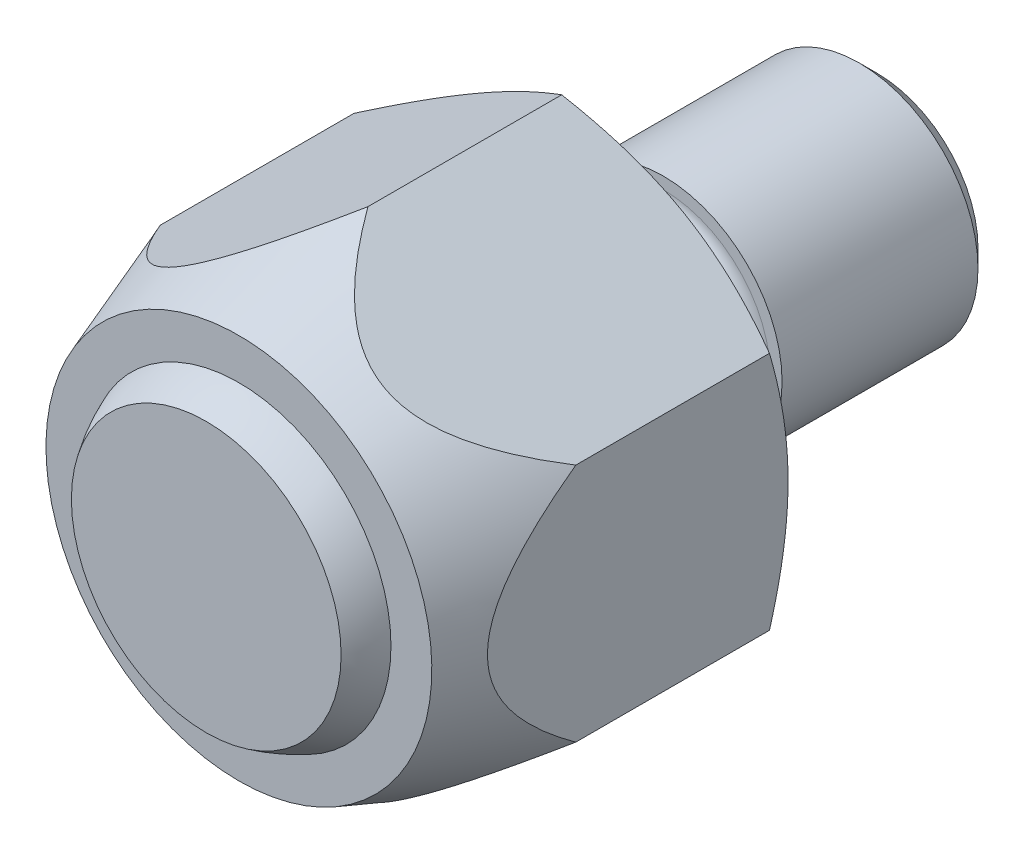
ISO-10303-21;
HEADER;
FILE_DESCRIPTION(('STEP AP214'),'2;1');
FILE_NAME('part.step','',(''),(''),'','','');
FILE_SCHEMA(('AUTOMOTIVE_DESIGN { 1 0 10303 214 1 1 1 1 }'));
ENDSEC;
DATA;
#1=APPLICATION_CONTEXT('core data for automotive mechanical design processes');
#2=APPLICATION_PROTOCOL_DEFINITION('international standard','automotive_design',2000,#1);
#3=PRODUCT_CONTEXT('',#1,'mechanical');
#4=PRODUCT('Part','Part','',(#3));
#5=PRODUCT_RELATED_PRODUCT_CATEGORY('part','',(#4));
#6=PRODUCT_DEFINITION_FORMATION('','',#4);
#7=PRODUCT_DEFINITION_CONTEXT('part definition',#1,'design');
#8=PRODUCT_DEFINITION('design','',#6,#7);
#9=PRODUCT_DEFINITION_SHAPE('','',#8);
#10=(LENGTH_UNIT() NAMED_UNIT(*) SI_UNIT(.MILLI.,.METRE.));
#11=(NAMED_UNIT(*) PLANE_ANGLE_UNIT() SI_UNIT($,.RADIAN.));
#12=(NAMED_UNIT(*) SI_UNIT($,.STERADIAN.) SOLID_ANGLE_UNIT());
#13=UNCERTAINTY_MEASURE_WITH_UNIT(LENGTH_MEASURE(1.E-05),#10,'distance_accuracy_value','');
#14=(GEOMETRIC_REPRESENTATION_CONTEXT(3) GLOBAL_UNCERTAINTY_ASSIGNED_CONTEXT((#13)) GLOBAL_UNIT_ASSIGNED_CONTEXT((#10,
#11,#12)) REPRESENTATION_CONTEXT('',''));
#15=CARTESIAN_POINT('',(0.,0.,0.));
#16=DIRECTION('',(0.,0.,1.));
#17=DIRECTION('',(1.,0.,0.));
#18=AXIS2_PLACEMENT_3D('',#15,#16,#17);
#19=CARTESIAN_POINT('',(0.,-4.04145188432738,5.75));
#20=DIRECTION('',(0.,0.,1.));
#21=DIRECTION('',(0.,-1.,0.));
#22=AXIS2_PLACEMENT_3D('',#19,#20,#21);
#23=PLANE('',#22);
#24=CARTESIAN_POINT('',(0.,0.,5.75));
#25=DIRECTION('',(0.,0.,1.));
#26=DIRECTION('',(0.,-1.,0.));
#27=AXIS2_PLACEMENT_3D('',#24,#25,#26);
#28=CIRCLE('',#27,3.25);
#29=CARTESIAN_POINT('',(0.,-3.25,5.75));
#30=VERTEX_POINT('',#29);
#31=EDGE_CURVE('E285',#30,#30,#28,.T.);
#32=ORIENTED_EDGE('',*,*,#31,.T.);
#33=EDGE_LOOP('',(#32));
#34=FACE_BOUND('',#33,.T.);
#35=CARTESIAN_POINT('',(0.,0.,5.75));
#36=DIRECTION('',(0.,0.,1.));
#37=DIRECTION('',(1.,0.,0.));
#38=AXIS2_PLACEMENT_3D('',#35,#36,#37);
#39=CIRCLE('',#38,2.5617376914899);
#40=CARTESIAN_POINT('',(2.5617376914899,0.,5.75));
#41=VERTEX_POINT('',#40);
#42=EDGE_CURVE('E18',#41,#41,#39,.F.);
#43=ORIENTED_EDGE('',*,*,#42,.T.);
#44=EDGE_LOOP('',(#43));
#45=FACE_BOUND('',#44,.T.);
#46=ADVANCED_FACE('F14',(#34,#45),#23,.T.);
#47=CARTESIAN_POINT('',(-3.5,-2.02072594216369,5.75));
#48=DIRECTION('',(0.5,0.866025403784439,0.));
#49=DIRECTION('',(-0.866025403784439,0.5,0.));
#50=AXIS2_PLACEMENT_3D('',#47,#48,#49);
#51=PLANE('',#50);
#52=CARTESIAN_POINT('',(0.300665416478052,-4.21504114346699,0.419012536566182));
#53=CARTESIAN_POINT('',(0.141435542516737,-4.1231097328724,0.35957553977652));
#54=CARTESIAN_POINT('',(-0.0191323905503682,-4.03040579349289,0.304292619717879));
#55=CARTESIAN_POINT('',(-0.34341006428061,-3.84318399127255,0.204891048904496));
#56=CARTESIAN_POINT('',(-0.507128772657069,-3.74866095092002,0.160811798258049));
#57=CARTESIAN_POINT('',(-0.832321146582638,-3.56091104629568,0.0881883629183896));
#58=CARTESIAN_POINT('',(-0.993723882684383,-3.4677251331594,0.0592337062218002));
#59=CARTESIAN_POINT('',(-1.31789493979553,-3.28056488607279,0.0176878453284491));
#60=CARTESIAN_POINT('',(-1.48066050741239,-3.18659214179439,0.00506920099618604));
#61=CARTESIAN_POINT('',(-1.7336006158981,-3.04055710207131,-0.000867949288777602));
#62=CARTESIAN_POINT('',(-1.82369346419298,-2.9885419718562,-0.000293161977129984));
#63=CARTESIAN_POINT('',(-2.00374276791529,-2.88459045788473,0.00618413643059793));
#64=CARTESIAN_POINT('',(-2.09369921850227,-2.83265407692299,0.0120868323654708));
#65=CARTESIAN_POINT('',(-2.27341220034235,-2.72889673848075,0.0290466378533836));
#66=CARTESIAN_POINT('',(-2.36316804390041,-2.67707617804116,0.0401133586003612));
#67=CARTESIAN_POINT('',(-2.54213836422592,-2.57374761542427,0.0670562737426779));
#68=CARTESIAN_POINT('',(-2.6313527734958,-2.52223965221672,0.0829330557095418));
#69=CARTESIAN_POINT('',(-2.90375180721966,-2.36496999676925,0.138297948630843));
#70=CARTESIAN_POINT('',(-3.08586781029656,-2.25982527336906,0.184928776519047));
#71=CARTESIAN_POINT('',(-3.3561714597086,-2.10376538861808,0.265542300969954));
#72=CARTESIAN_POINT('',(-3.44563340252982,-2.05211451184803,0.294129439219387));
#73=CARTESIAN_POINT('',(-3.62373871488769,-1.94928536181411,0.354380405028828));
#74=CARTESIAN_POINT('',(-3.71238240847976,-1.89810690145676,0.386042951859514));
#75=CARTESIAN_POINT('',(-3.80066541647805,-1.84713668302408,0.41901253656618));
#76=B_SPLINE_CURVE_WITH_KNOTS('',3,(#52,#53,#54,#55,#56,#57,#58,#59,#60,#61,#62,#63,#64,#65,#66,
#67,#68,#69,#70,#71,#72,#73,#74,#75),.UNSPECIFIED.,.F.,.F.,(4,2,2,2,2,2,2,2,2,2,2,4),(0.,
0.579938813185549,1.16188973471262,1.72709734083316,2.29135431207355,2.60332764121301,
2.9153117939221,3.22787893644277,3.54048427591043,4.1858765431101,4.5073996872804,
4.82878950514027),.UNSPECIFIED.);
#77=CARTESIAN_POINT('',(0.,-4.0414518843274,0.312607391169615));
#78=VERTEX_POINT('',#77);
#79=CARTESIAN_POINT('',(-1.75,-3.03108891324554,0.));
#80=VERTEX_POINT('',#79);
#81=EDGE_CURVE('E107',#78,#80,#76,.T.);
#82=ORIENTED_EDGE('',*,*,#81,.F.);
#83=DIRECTION('',(0.,0.,-1.));
#84=VECTOR('',#83,1.);
#85=CARTESIAN_POINT('',(0.,-4.04145188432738,5.75));
#86=LINE('',#85,#84);
#87=CARTESIAN_POINT('',(0.,-4.04145188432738,3.57550381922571));
#88=VERTEX_POINT('',#87);
#89=EDGE_CURVE('E122',#88,#78,#86,.T.);
#90=ORIENTED_EDGE('',*,*,#89,.F.);
#91=CARTESIAN_POINT('',(-3.5002,-2.02061047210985,3.57518655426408));
#92=CARTESIAN_POINT('',(-3.46864489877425,-2.03882881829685,3.62523927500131));
#93=CARTESIAN_POINT('',(-3.43667743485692,-2.05728524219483,3.6749441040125));
#94=CARTESIAN_POINT('',(-3.37180026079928,-2.09474209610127,3.77354741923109));
#95=CARTESIAN_POINT('',(-3.33889029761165,-2.11374267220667,3.82244568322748));
#96=CARTESIAN_POINT('',(-3.23812575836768,-2.17191910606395,3.96840572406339));
#97=CARTESIAN_POINT('',(-3.16867756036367,-2.21201504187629,4.06402457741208));
#98=CARTESIAN_POINT('',(-3.02167397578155,-2.29688760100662,4.25337741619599));
#99=CARTESIAN_POINT('',(-2.94390918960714,-2.34178512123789,4.34689638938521));
#100=CARTESIAN_POINT('',(-2.78114393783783,-2.43575768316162,4.5248178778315));
#101=CARTESIAN_POINT('',(-2.69616784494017,-2.48481865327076,4.60924907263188));
#102=CARTESIAN_POINT('',(-2.57346922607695,-2.55565873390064,4.71508337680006));
#103=CARTESIAN_POINT('',(-2.5397383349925,-2.57513327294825,4.74265851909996));
#104=CARTESIAN_POINT('',(-2.47091849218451,-2.61486642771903,4.79545546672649));
#105=CARTESIAN_POINT('',(-2.43582924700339,-2.63512521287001,4.82067675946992));
#106=CARTESIAN_POINT('',(-2.32886588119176,-2.69688054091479,4.89182552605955));
#107=CARTESIAN_POINT('',(-2.25483395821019,-2.73962289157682,4.93365063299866));
#108=CARTESIAN_POINT('',(-2.11606117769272,-2.81974339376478,4.99521765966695));
#109=CARTESIAN_POINT('',(-2.05222821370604,-2.85659737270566,5.0176457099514));
#110=CARTESIAN_POINT('',(-1.92216812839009,-2.93168759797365,5.04981737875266));
#111=CARTESIAN_POINT('',(-1.85594284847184,-2.9699227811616,5.05957054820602));
#112=CARTESIAN_POINT('',(-1.72279424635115,-3.04679616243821,5.06506861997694));
#113=CARTESIAN_POINT('',(-1.65586925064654,-3.08543532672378,5.06076173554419));
#114=CARTESIAN_POINT('',(-1.52377339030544,-3.16170090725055,5.03866395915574));
#115=CARTESIAN_POINT('',(-1.45860292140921,-3.199327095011,5.02087005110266));
#116=CARTESIAN_POINT('',(-1.31149435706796,-3.28426026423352,4.96659199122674));
#117=CARTESIAN_POINT('',(-1.23070869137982,-3.33090189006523,4.92599602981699));
#118=CARTESIAN_POINT('',(-1.11416281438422,-3.39818968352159,4.85459177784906));
#119=CARTESIAN_POINT('',(-1.07590157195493,-3.42027982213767,4.82887870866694));
#120=CARTESIAN_POINT('',(-1.00096726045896,-3.4635431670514,4.77453973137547));
#121=CARTESIAN_POINT('',(-0.964293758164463,-3.48471662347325,4.74591462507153));
#122=CARTESIAN_POINT('',(-0.833998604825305,-3.55994256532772,4.63779723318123));
#123=CARTESIAN_POINT('',(-0.74475244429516,-3.61146886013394,4.55128494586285));
#124=CARTESIAN_POINT('',(-0.574171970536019,-3.70995354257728,4.36808278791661));
#125=CARTESIAN_POINT('',(-0.492869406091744,-3.75689360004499,4.27135505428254));
#126=CARTESIAN_POINT('',(-0.340382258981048,-3.8449320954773,4.07631202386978));
#127=CARTESIAN_POINT('',(-0.268896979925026,-3.88620414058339,3.97830739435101));
#128=CARTESIAN_POINT('',(-0.165316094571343,-3.94600659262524,3.8286580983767));
#129=CARTESIAN_POINT('',(-0.13152939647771,-3.96551335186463,3.77854740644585));
#130=CARTESIAN_POINT('',(-0.0649509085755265,-4.00395245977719,3.67747500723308));
#131=CARTESIAN_POINT('',(-0.0321588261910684,-4.02288497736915,3.62651355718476));
#132=CARTESIAN_POINT('',(0.000200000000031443,-4.04156735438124,3.57518655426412));
#133=B_SPLINE_CURVE_WITH_KNOTS('',3,(#91,#92,#93,#94,#95,#96,#97,#98,#99,#100,#101,#102,#103,
#104,#105,#106,#107,#108,#109,#110,#111,#112,#113,#114,#115,#116,#117,#118,#119,#120,#121,#122,
#123,#124,#125,#126,#127,#128,#129,#130,#131,#132),.UNSPECIFIED.,.F.,.F.,(4,2,2,2,2,2,2,2,2,2,2,
2,2,2,2,2,2,2,2,2,4),(0.,0.1857244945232,0.37149932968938,0.745663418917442,1.13426168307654,
1.52159522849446,1.66468625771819,1.8078083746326,2.09204210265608,2.32226171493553,
2.55230774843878,2.78320205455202,3.01414801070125,3.31753365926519,3.47081235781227,
3.6240489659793,4.02648023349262,4.43045923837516,4.81462016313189,5.00512990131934,
5.1955830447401),.UNSPECIFIED.);
#134=CARTESIAN_POINT('',(-3.5,-2.02072594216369,3.57550381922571));
#135=VERTEX_POINT('',#134);
#136=EDGE_CURVE('E191',#135,#88,#133,.T.);
#137=ORIENTED_EDGE('',*,*,#136,.F.);
#138=DIRECTION('',(0.,0.,-1.));
#139=VECTOR('',#138,1.);
#140=CARTESIAN_POINT('',(-3.5,-2.02072594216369,5.75));
#141=LINE('',#140,#139);
#142=CARTESIAN_POINT('',(-3.5,-2.02072594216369,0.312607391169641));
#143=VERTEX_POINT('',#142);
#144=EDGE_CURVE('E207',#135,#143,#141,.T.);
#145=ORIENTED_EDGE('',*,*,#144,.T.);
#146=EDGE_CURVE('E178',#80,#143,#76,.T.);
#147=ORIENTED_EDGE('',*,*,#146,.F.);
#148=EDGE_LOOP('',(#82,#90,#137,#145,#147));
#149=FACE_BOUND('',#148,.T.);
#150=ADVANCED_FACE('F183',(#149),#51,.F.);
#151=CARTESIAN_POINT('',(0.,-4.04145188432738,5.75));
#152=DIRECTION('',(-0.5,0.866025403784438,0.));
#153=DIRECTION('',(-0.866025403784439,-0.5,0.));
#154=AXIS2_PLACEMENT_3D('',#151,#152,#153);
#155=PLANE('',#154);
#156=CARTESIAN_POINT('',(3.80066541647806,-1.84713668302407,0.419012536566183));
#157=CARTESIAN_POINT('',(3.64143554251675,-1.93906809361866,0.35957553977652));
#158=CARTESIAN_POINT('',(3.48086760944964,-2.03177203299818,0.304292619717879));
#159=CARTESIAN_POINT('',(3.1565899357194,-2.21899383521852,0.204891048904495));
#160=CARTESIAN_POINT('',(2.99287122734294,-2.31351687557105,0.160811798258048));
#161=CARTESIAN_POINT('',(2.66767885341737,-2.50126678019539,0.0881883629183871));
#162=CARTESIAN_POINT('',(2.50627611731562,-2.59445269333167,0.0592337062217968));
#163=CARTESIAN_POINT('',(2.18210506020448,-2.78161294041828,0.0176878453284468));
#164=CARTESIAN_POINT('',(2.01933949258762,-2.87558568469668,0.00506920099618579));
#165=CARTESIAN_POINT('',(1.7663993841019,-3.02162072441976,-0.000867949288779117));
#166=CARTESIAN_POINT('',(1.67630653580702,-3.07363585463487,-0.000293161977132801));
#167=CARTESIAN_POINT('',(1.49625723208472,-3.17758736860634,0.00618413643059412));
#168=CARTESIAN_POINT('',(1.40630078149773,-3.22952374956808,0.0120868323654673));
#169=CARTESIAN_POINT('',(1.22658779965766,-3.33328108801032,0.0290466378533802));
#170=CARTESIAN_POINT('',(1.13683195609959,-3.38510164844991,0.0401133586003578));
#171=CARTESIAN_POINT('',(0.957861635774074,-3.4884302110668,0.0670562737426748));
#172=CARTESIAN_POINT('',(0.868647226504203,-3.53993817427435,0.082933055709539));
#173=CARTESIAN_POINT('',(0.596248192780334,-3.69720782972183,0.138297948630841));
#174=CARTESIAN_POINT('',(0.414132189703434,-3.80235255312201,0.184928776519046));
#175=CARTESIAN_POINT('',(0.14382854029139,-3.95841243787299,0.265542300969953));
#176=CARTESIAN_POINT('',(0.0543665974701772,-4.01006331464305,0.294129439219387));
#177=CARTESIAN_POINT('',(-0.123738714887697,-4.11289246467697,0.354380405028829));
#178=CARTESIAN_POINT('',(-0.212382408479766,-4.16407092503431,0.386042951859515));
#179=CARTESIAN_POINT('',(-0.300665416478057,-4.215041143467,0.419012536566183));
#180=B_SPLINE_CURVE_WITH_KNOTS('',3,(#156,#157,#158,#159,#160,#161,#162,#163,#164,#165,#166,
#167,#168,#169,#170,#171,#172,#173,#174,#175,#176,#177,#178,#179),.UNSPECIFIED.,.F.,.F.,(4,2,2,
2,2,2,2,2,2,2,2,4),(0.,0.579938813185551,1.16188973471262,1.72709734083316,2.29135431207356,
2.60332764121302,2.91531179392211,3.22787893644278,3.54048427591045,4.18587654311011,
4.50739968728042,4.8287895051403),.UNSPECIFIED.);
#181=CARTESIAN_POINT('',(3.5,-2.02072594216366,0.312607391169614));
#182=VERTEX_POINT('',#181);
#183=CARTESIAN_POINT('',(1.75,-3.03108891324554,0.));
#184=VERTEX_POINT('',#183);
#185=EDGE_CURVE('E86',#182,#184,#180,.T.);
#186=ORIENTED_EDGE('',*,*,#185,.F.);
#187=DIRECTION('',(0.,0.,-1.));
#188=VECTOR('',#187,1.);
#189=CARTESIAN_POINT('',(3.5,-2.02072594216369,5.75));
#190=LINE('',#189,#188);
#191=CARTESIAN_POINT('',(3.5,-2.02072594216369,3.57550381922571));
#192=VERTEX_POINT('',#191);
#193=EDGE_CURVE('E219',#192,#182,#190,.T.);
#194=ORIENTED_EDGE('',*,*,#193,.F.);
#195=CARTESIAN_POINT('',(-0.000200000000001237,-4.04156735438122,3.57518655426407));
#196=CARTESIAN_POINT('',(0.0313551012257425,-4.02334900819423,3.62523927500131));
#197=CARTESIAN_POINT('',(0.063322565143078,-4.00489258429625,3.6749441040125));
#198=CARTESIAN_POINT('',(0.128199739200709,-3.96743573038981,3.7735474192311));
#199=CARTESIAN_POINT('',(0.161109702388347,-3.94843515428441,3.82244568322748));
#200=CARTESIAN_POINT('',(0.26187424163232,-3.89025872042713,3.9684057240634));
#201=CARTESIAN_POINT('',(0.331322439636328,-3.85016278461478,4.06402457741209));
#202=CARTESIAN_POINT('',(0.478326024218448,-3.76529022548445,4.253377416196));
#203=CARTESIAN_POINT('',(0.556090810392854,-3.72039270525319,4.34689638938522));
#204=CARTESIAN_POINT('',(0.718856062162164,-3.62642014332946,4.5248178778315));
#205=CARTESIAN_POINT('',(0.803832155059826,-3.57735917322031,4.60924907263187));
#206=CARTESIAN_POINT('',(0.926530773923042,-3.50651909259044,4.71508337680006));
#207=CARTESIAN_POINT('',(0.960261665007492,-3.48704455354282,4.74265851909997));
#208=CARTESIAN_POINT('',(1.02908150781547,-3.44731139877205,4.7954554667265));
#209=CARTESIAN_POINT('',(1.0641707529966,-3.42705261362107,4.82067675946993));
#210=CARTESIAN_POINT('',(1.17113411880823,-3.36529728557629,4.89182552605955));
#211=CARTESIAN_POINT('',(1.24516604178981,-3.32255493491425,4.93365063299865));
#212=CARTESIAN_POINT('',(1.38393882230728,-3.2424344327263,4.99521765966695));
#213=CARTESIAN_POINT('',(1.44777178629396,-3.20558045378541,5.01764570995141));
#214=CARTESIAN_POINT('',(1.5778318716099,-3.13049022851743,5.04981737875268));
#215=CARTESIAN_POINT('',(1.64405715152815,-3.09225504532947,5.05957054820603));
#216=CARTESIAN_POINT('',(1.77720575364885,-3.01538166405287,5.06506861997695));
#217=CARTESIAN_POINT('',(1.84413074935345,-2.97674249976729,5.06076173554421));
#218=CARTESIAN_POINT('',(1.97622660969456,-2.90047691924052,5.03866395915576));
#219=CARTESIAN_POINT('',(2.04139707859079,-2.86285073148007,5.02087005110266));
#220=CARTESIAN_POINT('',(2.18850564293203,-2.77791756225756,4.96659199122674));
#221=CARTESIAN_POINT('',(2.26929130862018,-2.73127593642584,4.92599602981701));
#222=CARTESIAN_POINT('',(2.38583718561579,-2.66398814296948,4.85459177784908));
#223=CARTESIAN_POINT('',(2.42409842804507,-2.6418980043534,4.82887870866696));
#224=CARTESIAN_POINT('',(2.49903273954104,-2.59863465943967,4.77453973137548));
#225=CARTESIAN_POINT('',(2.53570624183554,-2.57746120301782,4.74591462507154));
#226=CARTESIAN_POINT('',(2.66600139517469,-2.50223526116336,4.63779723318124));
#227=CARTESIAN_POINT('',(2.75524755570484,-2.45070896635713,4.55128494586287));
#228=CARTESIAN_POINT('',(2.92582802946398,-2.3522242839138,4.36808278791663));
#229=CARTESIAN_POINT('',(3.00713059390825,-2.30528422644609,4.27135505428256));
#230=CARTESIAN_POINT('',(3.15961774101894,-2.21724573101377,4.07631202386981));
#231=CARTESIAN_POINT('',(3.23110302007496,-2.17597368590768,3.97830739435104));
#232=CARTESIAN_POINT('',(3.33468390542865,-2.11617123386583,3.82865809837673));
#233=CARTESIAN_POINT('',(3.36847060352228,-2.09666447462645,3.77854740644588));
#234=CARTESIAN_POINT('',(3.43504909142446,-2.05822536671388,3.6774750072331));
#235=CARTESIAN_POINT('',(3.46784117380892,-2.03929284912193,3.62651355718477));
#236=CARTESIAN_POINT('',(3.5002,-2.02061047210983,3.57518655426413));
#237=B_SPLINE_CURVE_WITH_KNOTS('',3,(#195,#196,#197,#198,#199,#200,#201,#202,#203,#204,#205,
#206,#207,#208,#209,#210,#211,#212,#213,#214,#215,#216,#217,#218,#219,#220,#221,#222,#223,#224,
#225,#226,#227,#228,#229,#230,#231,#232,#233,#234,#235,#236),.UNSPECIFIED.,.F.,.F.,(4,2,2,2,2,2,
2,2,2,2,2,2,2,2,2,2,2,2,2,2,4),(0.,0.185724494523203,0.371499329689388,0.745663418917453,
1.13426168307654,1.52159522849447,1.6646862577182,1.8078083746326,2.09204210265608,
2.32226171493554,2.55230774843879,2.78320205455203,3.01414801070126,3.31753365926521,
3.47081235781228,3.62404896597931,4.02648023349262,4.43045923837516,4.81462016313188,
5.00512990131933,5.19558304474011),.UNSPECIFIED.);
#238=EDGE_CURVE('E199',#88,#192,#237,.T.);
#239=ORIENTED_EDGE('',*,*,#238,.F.);
#240=ORIENTED_EDGE('',*,*,#89,.T.);
#241=EDGE_CURVE('E99',#184,#78,#180,.T.);
#242=ORIENTED_EDGE('',*,*,#241,.F.);
#243=EDGE_LOOP('',(#186,#194,#239,#240,#242));
#244=FACE_BOUND('',#243,.T.);
#245=ADVANCED_FACE('F119',(#244),#155,.F.);
#246=CARTESIAN_POINT('',(3.5,-2.02072594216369,5.75));
#247=DIRECTION('',(-1.,0.,0.));
#248=DIRECTION('',(0.,0.,-1.));
#249=AXIS2_PLACEMENT_3D('',#246,#247,#248);
#250=PLANE('',#249);
#251=CARTESIAN_POINT('',(3.5,5.49260232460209,1.73953470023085));
#252=CARTESIAN_POINT('',(3.5,5.33910234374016,1.66481557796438));
#253=CARTESIAN_POINT('',(3.5,5.18525670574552,1.59079471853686));
#254=CARTESIAN_POINT('',(3.5,4.87669038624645,1.44454125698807));
#255=CARTESIAN_POINT('',(3.5,4.72196957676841,1.37230892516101));
#256=CARTESIAN_POINT('',(3.5,4.41070363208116,1.22967504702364));
#257=CARTESIAN_POINT('',(3.5,4.25415318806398,1.15928504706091));
#258=CARTESIAN_POINT('',(3.5,3.93982867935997,1.02130289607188));
#259=CARTESIAN_POINT('',(3.5,3.78205467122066,0.953710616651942));
#260=CARTESIAN_POINT('',(3.5,3.4598580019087,0.819912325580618));
#261=CARTESIAN_POINT('',(3.5,3.29538639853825,0.753823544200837));
#262=CARTESIAN_POINT('',(3.5,2.96454347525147,0.626493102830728));
#263=CARTESIAN_POINT('',(3.5,2.79817194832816,0.565251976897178));
#264=CARTESIAN_POINT('',(3.5,2.46355465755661,0.449176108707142));
#265=CARTESIAN_POINT('',(3.5,2.29531323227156,0.39432898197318));
#266=CARTESIAN_POINT('',(3.5,1.9564186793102,0.292757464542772));
#267=CARTESIAN_POINT('',(3.5,1.7857663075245,0.246030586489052));
#268=CARTESIAN_POINT('',(3.5,1.44283316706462,0.163129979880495));
#269=CARTESIAN_POINT('',(3.5,1.27056590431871,0.12690139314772));
#270=CARTESIAN_POINT('',(3.5,0.923824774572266,0.0670274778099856));
#271=CARTESIAN_POINT('',(3.5,0.749351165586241,0.0433806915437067));
#272=CARTESIAN_POINT('',(3.5,0.401367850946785,0.0108622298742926));
#273=CARTESIAN_POINT('',(3.5,0.227876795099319,0.00179591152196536));
#274=CARTESIAN_POINT('',(3.5,-0.119261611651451,-0.00130942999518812));
#275=CARTESIAN_POINT('',(3.5,-0.292908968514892,0.00465214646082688));
#276=CARTESIAN_POINT('',(3.5,-0.585701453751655,0.0269466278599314));
#277=CARTESIAN_POINT('',(3.5,-0.705152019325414,0.0395173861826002));
#278=CARTESIAN_POINT('',(3.5,-0.943216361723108,0.0710229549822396));
#279=CARTESIAN_POINT('',(3.5,-1.06183003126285,0.0899585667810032));
#280=CARTESIAN_POINT('',(3.5,-1.41622304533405,0.15532046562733));
#281=CARTESIAN_POINT('',(3.5,-1.65044588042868,0.210292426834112));
#282=CARTESIAN_POINT('',(3.5,-2.00100478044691,0.306150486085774));
#283=CARTESIAN_POINT('',(3.5,-2.11913957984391,0.340836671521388));
#284=CARTESIAN_POINT('',(3.5,-2.35426159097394,0.413936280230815));
#285=CARTESIAN_POINT('',(3.5,-2.47124879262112,0.452349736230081));
#286=CARTESIAN_POINT('',(3.5,-2.70411627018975,0.532277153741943));
#287=CARTESIAN_POINT('',(3.5,-2.81999681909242,0.573790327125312));
#288=CARTESIAN_POINT('',(3.5,-3.05078474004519,0.659416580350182));
#289=CARTESIAN_POINT('',(3.5,-3.16569215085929,0.703529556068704));
#290=CARTESIAN_POINT('',(3.5,-3.53512825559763,0.849369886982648));
#291=CARTESIAN_POINT('',(3.5,-3.78796786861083,0.955373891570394));
#292=CARTESIAN_POINT('',(3.5,-4.29048826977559,1.17465307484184));
#293=CARTESIAN_POINT('',(3.5,-4.5401684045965,1.2879297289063));
#294=CARTESIAN_POINT('',(3.5,-5.03730151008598,1.51965554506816));
#295=CARTESIAN_POINT('',(3.5,-5.28475295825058,1.63810796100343));
#296=CARTESIAN_POINT('',(3.5,-5.77783514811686,1.87867750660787));
#297=CARTESIAN_POINT('',(3.5,-6.02346603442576,2.00079434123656));
#298=CARTESIAN_POINT('',(3.5,-6.51390713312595,2.24802369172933));
#299=CARTESIAN_POINT('',(3.5,-6.75871424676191,2.37314234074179));
#300=CARTESIAN_POINT('',(3.5,-7.24726103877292,2.6254526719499));
#301=CARTESIAN_POINT('',(3.5,-7.49100069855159,2.75264439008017));
#302=CARTESIAN_POINT('',(3.5,-8.22079122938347,3.13649641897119));
#303=CARTESIAN_POINT('',(3.5,-8.70559497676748,3.39552598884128));
#304=CARTESIAN_POINT('',(3.5,-9.60603003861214,3.88136903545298));
#305=CARTESIAN_POINT('',(3.5,-10.0219376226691,4.10767294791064));
#306=CARTESIAN_POINT('',(3.5,-10.8526509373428,4.56239812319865));
#307=CARTESIAN_POINT('',(3.5,-11.267456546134,4.79081960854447));
#308=CARTESIAN_POINT('',(3.5,-12.0944948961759,5.24822062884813));
#309=CARTESIAN_POINT('',(3.5,-12.506731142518,5.47719383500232));
#310=CARTESIAN_POINT('',(3.5,-13.330511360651,5.93626827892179));
#311=CARTESIAN_POINT('',(3.5,-13.7420554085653,6.16636938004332));
#312=CARTESIAN_POINT('',(3.5,-14.1533723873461,6.3968736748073));
#313=B_SPLINE_CURVE_WITH_KNOTS('',3,(#251,#252,#253,#254,#255,#256,#257,#258,#259,#260,#261,
#262,#263,#264,#265,#266,#267,#268,#269,#270,#271,#272,#273,#274,#275,#276,#277,#278,#279,#280,
#281,#282,#283,#284,#285,#286,#287,#288,#289,#290,#291,#292,#293,#294,#295,#296,#297,#298,#299,
#300,#301,#302,#303,#304,#305,#306,#307,#308,#309,#310,#311,#312),.UNSPECIFIED.,.F.,.F.,(4,2,2,
2,2,2,2,2,2,2,2,2,2,2,2,2,2,2,2,2,2,2,2,2,2,2,2,2,2,2,4),(0.,0.512164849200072,1.02440663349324,
1.53932656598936,2.05422284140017,2.58592282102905,3.1176812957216,3.64839207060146,
4.17893999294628,4.7066634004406,5.23432565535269,5.75488355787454,6.27546223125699,
6.63561970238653,6.99582253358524,7.71655346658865,8.08588537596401,8.45522052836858,
8.82446209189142,9.1936888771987,10.0159775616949,10.8384335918,11.6614143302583,
12.4843289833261,13.3090989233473,14.1338831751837,15.7828412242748,17.2033050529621,
18.6239198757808,20.0385936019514,21.4530999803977),.UNSPECIFIED.);
#314=CARTESIAN_POINT('',(3.5,2.02072594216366,0.312607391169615));
#315=VERTEX_POINT('',#314);
#316=CARTESIAN_POINT('',(3.5,0.,0.));
#317=VERTEX_POINT('',#316);
#318=EDGE_CURVE('E30',#315,#317,#313,.T.);
#319=ORIENTED_EDGE('',*,*,#318,.F.);
#320=DIRECTION('',(0.,0.,-1.));
#321=VECTOR('',#320,1.);
#322=CARTESIAN_POINT('',(3.5,2.02072594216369,5.75));
#323=LINE('',#322,#321);
#324=CARTESIAN_POINT('',(3.5,2.02072594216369,3.57550381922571));
#325=VERTEX_POINT('',#324);
#326=EDGE_CURVE('E216',#325,#315,#323,.T.);
#327=ORIENTED_EDGE('',*,*,#326,.F.);
#328=CARTESIAN_POINT('',(3.5,8.85854225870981,-11.4901534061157));
#329=CARTESIAN_POINT('',(3.5,8.65346441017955,-10.9661969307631));
#330=CARTESIAN_POINT('',(3.5,8.44759864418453,-10.4425466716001));
#331=CARTESIAN_POINT('',(3.5,8.03378097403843,-9.39602760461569));
#332=CARTESIAN_POINT('',(3.5,7.82582891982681,-8.87315885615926));
#333=CARTESIAN_POINT('',(3.5,7.40666555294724,-7.82671926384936));
#334=CARTESIAN_POINT('',(3.5,7.19544573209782,-7.30315182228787));
#335=CARTESIAN_POINT('',(3.5,6.76968517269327,-6.25740230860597));
#336=CARTESIAN_POINT('',(3.5,6.55514462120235,-5.73522016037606));
#337=CARTESIAN_POINT('',(3.5,6.10000410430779,-4.6405007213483));
#338=CARTESIAN_POINT('',(3.5,5.85894477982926,-4.06815351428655));
#339=CARTESIAN_POINT('',(3.5,5.49171590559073,-3.21198660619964));
#340=CARTESIAN_POINT('',(3.5,5.36835421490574,-2.9269627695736));
#341=CARTESIAN_POINT('',(3.5,5.11934493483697,-2.35791634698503));
#342=CARTESIAN_POINT('',(3.5,4.99369736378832,-2.07389375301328));
#343=CARTESIAN_POINT('',(3.5,4.73983104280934,-1.50763475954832));
#344=CARTESIAN_POINT('',(3.5,4.61161753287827,-1.22539601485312));
#345=CARTESIAN_POINT('',(3.5,4.35168606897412,-0.6625399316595));
#346=CARTESIAN_POINT('',(3.5,4.21996819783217,-0.381922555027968));
#347=CARTESIAN_POINT('',(3.5,3.95207176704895,0.177076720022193));
#348=CARTESIAN_POINT('',(3.5,3.81589455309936,0.455459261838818));
#349=CARTESIAN_POINT('',(3.5,3.53762550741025,1.00924401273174));
#350=CARTESIAN_POINT('',(3.5,3.39553426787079,1.28464651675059));
#351=CARTESIAN_POINT('',(3.5,3.18611565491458,1.6760946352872));
#352=CARTESIAN_POINT('',(3.5,3.12210210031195,1.79391394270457));
#353=CARTESIAN_POINT('',(3.5,2.992279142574,2.02856669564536));
#354=CARTESIAN_POINT('',(3.5,2.92646967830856,2.14540010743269));
#355=CARTESIAN_POINT('',(3.5,2.79265401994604,2.37801689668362));
#356=CARTESIAN_POINT('',(3.5,2.72464495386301,2.49379862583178));
#357=CARTESIAN_POINT('',(3.5,2.58611476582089,2.72384620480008));
#358=CARTESIAN_POINT('',(3.5,2.51559377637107,2.83811213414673));
#359=CARTESIAN_POINT('',(3.5,2.37232726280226,3.06344156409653));
#360=CARTESIAN_POINT('',(3.5,2.29961581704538,3.17452665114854));
#361=CARTESIAN_POINT('',(3.5,2.15056596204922,3.39423283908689));
#362=CARTESIAN_POINT('',(3.5,2.07422798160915,3.50285422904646));
#363=CARTESIAN_POINT('',(3.5,1.91717757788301,3.71658373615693));
#364=CARTESIAN_POINT('',(3.5,1.83647384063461,3.82169820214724));
#365=CARTESIAN_POINT('',(3.5,1.66938918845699,4.02728426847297));
#366=CARTESIAN_POINT('',(3.5,1.58301186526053,4.12775873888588));
#367=CARTESIAN_POINT('',(3.5,1.44600955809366,4.2754302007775));
#368=CARTESIAN_POINT('',(3.5,1.39806126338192,4.32510917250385));
#369=CARTESIAN_POINT('',(3.5,1.29984499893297,4.42215757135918));
#370=CARTESIAN_POINT('',(3.5,1.24957648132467,4.46952644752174));
#371=CARTESIAN_POINT('',(3.5,1.14646177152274,4.56127147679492));
#372=CARTESIAN_POINT('',(3.5,1.09361864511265,4.60565104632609));
#373=CARTESIAN_POINT('',(3.5,0.984983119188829,4.69061220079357));
#374=CARTESIAN_POINT('',(3.5,0.929191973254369,4.73119538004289));
#375=CARTESIAN_POINT('',(3.5,0.795285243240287,4.82011993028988));
#376=CARTESIAN_POINT('',(3.5,0.715890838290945,4.86658550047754));
#377=CARTESIAN_POINT('',(3.5,0.551036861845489,4.94721461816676));
#378=CARTESIAN_POINT('',(3.5,0.465588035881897,4.98139933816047));
#379=CARTESIAN_POINT('',(3.5,0.306405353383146,5.02831093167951));
#380=CARTESIAN_POINT('',(3.5,0.233526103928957,5.04387899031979));
#381=CARTESIAN_POINT('',(3.5,0.0861839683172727,5.06233332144));
#382=CARTESIAN_POINT('',(3.5,0.0117225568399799,5.06523092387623));
#383=CARTESIAN_POINT('',(3.5,-0.136539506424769,5.05797320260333));
#384=CARTESIAN_POINT('',(3.5,-0.210340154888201,5.04781781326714));
#385=CARTESIAN_POINT('',(3.5,-0.355305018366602,5.01575510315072));
#386=CARTESIAN_POINT('',(3.5,-0.426467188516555,4.99383886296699));
#387=CARTESIAN_POINT('',(3.5,-0.59958044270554,4.92714410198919));
#388=CARTESIAN_POINT('',(3.5,-0.699205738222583,4.87641522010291));
#389=CARTESIAN_POINT('',(3.5,-0.8897567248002,4.76058126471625));
#390=CARTESIAN_POINT('',(3.5,-0.980648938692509,4.69542380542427));
#391=CARTESIAN_POINT('',(3.5,-1.18351715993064,4.53280223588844));
#392=CARTESIAN_POINT('',(3.5,-1.29257882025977,4.43176540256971));
#393=CARTESIAN_POINT('',(3.5,-1.50073735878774,4.21978467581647));
#394=CARTESIAN_POINT('',(3.5,-1.59981200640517,4.10881967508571));
#395=CARTESIAN_POINT('',(3.5,-1.79158327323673,3.8791487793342));
#396=CARTESIAN_POINT('',(3.5,-1.88418210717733,3.7603620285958));
#397=CARTESIAN_POINT('',(3.5,-2.01856026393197,3.57898943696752));
#398=CARTESIAN_POINT('',(3.5,-2.06257772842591,3.51803263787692));
#399=CARTESIAN_POINT('',(3.5,-2.1492986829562,3.39519293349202));
#400=CARTESIAN_POINT('',(3.5,-2.19200221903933,3.33331006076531));
#401=CARTESIAN_POINT('',(3.5,-2.33258935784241,3.12549364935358));
#402=CARTESIAN_POINT('',(3.5,-2.42790192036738,2.97781982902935));
#403=CARTESIAN_POINT('',(3.5,-2.61370722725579,2.67945914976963));
#404=CARTESIAN_POINT('',(3.5,-2.70419898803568,2.52877168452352));
#405=CARTESIAN_POINT('',(3.5,-2.8814200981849,2.2250797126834));
#406=CARTESIAN_POINT('',(3.5,-2.9681470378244,2.07207380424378));
#407=CARTESIAN_POINT('',(3.5,-3.13851676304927,1.76435071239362));
#408=CARTESIAN_POINT('',(3.5,-3.22215937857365,1.6096334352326));
#409=CARTESIAN_POINT('',(3.5,-3.46987619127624,1.1424326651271));
#410=CARTESIAN_POINT('',(3.5,-3.63014743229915,0.827934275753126));
#411=CARTESIAN_POINT('',(3.5,-3.94353583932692,0.195573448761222));
#412=CARTESIAN_POINT('',(3.5,-4.09665563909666,-0.122287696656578));
#413=CARTESIAN_POINT('',(3.5,-4.37987084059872,-0.72279318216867));
#414=CARTESIAN_POINT('',(3.5,-4.51054973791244,-1.00516313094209));
#415=CARTESIAN_POINT('',(3.5,-4.76870509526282,-1.57139772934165));
#416=CARTESIAN_POINT('',(3.5,-4.89618119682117,-1.8552625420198));
#417=CARTESIAN_POINT('',(3.5,-5.14770548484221,-2.42222229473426));
#418=CARTESIAN_POINT('',(3.5,-5.27177095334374,-2.70530958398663));
#419=CARTESIAN_POINT('',(3.5,-5.51777540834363,-3.27235449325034));
#420=CARTESIAN_POINT('',(3.5,-5.63971472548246,-3.55631196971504));
#421=CARTESIAN_POINT('',(3.5,-5.76081966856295,-3.84062080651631));
#422=B_SPLINE_CURVE_WITH_KNOTS('',3,(#328,#329,#330,#331,#332,#333,#334,#335,#336,#337,#338,
#339,#340,#341,#342,#343,#344,#345,#346,#347,#348,#349,#350,#351,#352,#353,#354,#355,#356,#357,
#358,#359,#360,#361,#362,#363,#364,#365,#366,#367,#368,#369,#370,#371,#372,#373,#374,#375,#376,
#377,#378,#379,#380,#381,#382,#383,#384,#385,#386,#387,#388,#389,#390,#391,#392,#393,#394,#395,
#396,#397,#398,#399,#400,#401,#402,#403,#404,#405,#406,#407,#408,#409,#410,#411,#412,#413,#414,
#415,#416,#417,#418,#419,#420,#421),.UNSPECIFIED.,.F.,.F.,(4,2,2,2,2,2,2,2,2,2,2,2,2,2,2,2,2,2,
2,2,2,2,2,2,2,2,2,2,2,2,2,2,2,2,2,2,2,2,2,2,2,2,2,2,2,2,4),(0.,1.6879850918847,3.3760924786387,
5.06978604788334,6.76338455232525,8.62646109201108,9.55817784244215,10.4898871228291,
11.4198563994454,12.3498037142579,13.2794729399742,14.2090492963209,14.6112959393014,
15.0135562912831,15.4163649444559,15.8191523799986,16.2173950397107,16.6155907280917,
17.0130213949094,17.410202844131,17.6172734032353,17.8243931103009,18.0312719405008,
18.238063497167,18.5132752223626,18.7880101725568,19.0106018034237,19.2329943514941,
19.4553880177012,19.6779505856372,20.0114057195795,20.3460919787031,20.7909992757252,
21.2368760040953,21.6884556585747,21.9140089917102,22.1395544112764,22.666697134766,
23.1939470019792,23.7215295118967,24.2491410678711,25.3079366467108,26.3663391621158,
27.2997418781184,28.2332486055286,29.1604804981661,30.0875668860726),.UNSPECIFIED.);
#423=EDGE_CURVE('E296',#192,#325,#422,.F.);
#424=ORIENTED_EDGE('',*,*,#423,.F.);
#425=ORIENTED_EDGE('',*,*,#193,.T.);
#426=EDGE_CURVE('E93',#317,#182,#313,.T.);
#427=ORIENTED_EDGE('',*,*,#426,.F.);
#428=EDGE_LOOP('',(#319,#327,#424,#425,#427));
#429=FACE_BOUND('',#428,.T.);
#430=ADVANCED_FACE('F304',(#429),#250,.F.);
#431=CARTESIAN_POINT('',(3.5,2.02072594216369,5.75));
#432=DIRECTION('',(-0.5,-0.866025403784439,0.));
#433=DIRECTION('',(0.866025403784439,-0.5,0.));
#434=AXIS2_PLACEMENT_3D('',#431,#432,#433);
#435=PLANE('',#434);
#436=CARTESIAN_POINT('',(-0.300665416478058,4.215041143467,0.419012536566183));
#437=CARTESIAN_POINT('',(-0.141435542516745,4.1231097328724,0.359575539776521));
#438=CARTESIAN_POINT('',(0.0191323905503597,4.03040579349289,0.304292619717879));
#439=CARTESIAN_POINT('',(0.343410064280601,3.84318399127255,0.204891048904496));
#440=CARTESIAN_POINT('',(0.507128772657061,3.74866095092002,0.160811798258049));
#441=CARTESIAN_POINT('',(0.83232114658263,3.56091104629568,0.0881883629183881));
#442=CARTESIAN_POINT('',(0.993723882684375,3.4677251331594,0.059233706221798));
#443=CARTESIAN_POINT('',(1.31789493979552,3.28056488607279,0.0176878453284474));
#444=CARTESIAN_POINT('',(1.48066050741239,3.18659214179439,0.00506920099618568));
#445=CARTESIAN_POINT('',(1.7336006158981,3.04055710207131,-0.00086794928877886));
#446=CARTESIAN_POINT('',(1.82369346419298,2.9885419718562,-0.00029316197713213));
#447=CARTESIAN_POINT('',(2.00374276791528,2.88459045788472,0.00618413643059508));
#448=CARTESIAN_POINT('',(2.09369921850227,2.83265407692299,0.0120868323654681));
#449=CARTESIAN_POINT('',(2.27341220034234,2.72889673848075,0.0290466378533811));
#450=CARTESIAN_POINT('',(2.36316804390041,2.67707617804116,0.0401133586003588));
#451=CARTESIAN_POINT('',(2.54213836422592,2.57374761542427,0.0670562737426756));
#452=CARTESIAN_POINT('',(2.63135277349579,2.52223965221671,0.0829330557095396));
#453=CARTESIAN_POINT('',(2.90375180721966,2.36496999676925,0.138297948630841));
#454=CARTESIAN_POINT('',(3.08586781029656,2.25982527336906,0.184928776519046));
#455=CARTESIAN_POINT('',(3.35617145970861,2.10376538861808,0.265542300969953));
#456=CARTESIAN_POINT('',(3.44563340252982,2.05211451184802,0.294129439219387));
#457=CARTESIAN_POINT('',(3.62373871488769,1.9492853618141,0.354380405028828));
#458=CARTESIAN_POINT('',(3.71238240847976,1.89810690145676,0.386042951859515));
#459=CARTESIAN_POINT('',(3.80066541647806,1.84713668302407,0.419012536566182));
#460=B_SPLINE_CURVE_WITH_KNOTS('',3,(#436,#437,#438,#439,#440,#441,#442,#443,#444,#445,#446,
#447,#448,#449,#450,#451,#452,#453,#454,#455,#456,#457,#458,#459),.UNSPECIFIED.,.F.,.F.,(4,2,2,
2,2,2,2,2,2,2,2,4),(0.,0.57993881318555,1.16188973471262,1.72709734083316,2.29135431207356,
2.60332764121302,2.9153117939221,3.22787893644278,3.54048427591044,4.18587654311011,
4.50739968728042,4.82878950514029),.UNSPECIFIED.);
#461=CARTESIAN_POINT('',(0.,4.0414518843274,0.312607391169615));
#462=VERTEX_POINT('',#461);
#463=CARTESIAN_POINT('',(1.75,3.03108891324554,0.));
#464=VERTEX_POINT('',#463);
#465=EDGE_CURVE('E38',#462,#464,#460,.T.);
#466=ORIENTED_EDGE('',*,*,#465,.F.);
#467=DIRECTION('',(0.,0.,-1.));
#468=VECTOR('',#467,1.);
#469=CARTESIAN_POINT('',(0.,4.04145188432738,5.75));
#470=LINE('',#469,#468);
#471=CARTESIAN_POINT('',(0.,4.04145188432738,3.57550381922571));
#472=VERTEX_POINT('',#471);
#473=EDGE_CURVE('E213',#472,#462,#470,.T.);
#474=ORIENTED_EDGE('',*,*,#473,.F.);
#475=CARTESIAN_POINT('',(3.5002,2.02061047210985,3.57518655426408));
#476=CARTESIAN_POINT('',(3.46864489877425,2.03882881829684,3.62523927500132));
#477=CARTESIAN_POINT('',(3.43667743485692,2.05728524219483,3.67494410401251));
#478=CARTESIAN_POINT('',(3.37180026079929,2.09474209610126,3.7735474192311));
#479=CARTESIAN_POINT('',(3.33889029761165,2.11374267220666,3.82244568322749));
#480=CARTESIAN_POINT('',(3.23812575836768,2.17191910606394,3.9684057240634));
#481=CARTESIAN_POINT('',(3.16867756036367,2.21201504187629,4.06402457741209));
#482=CARTESIAN_POINT('',(3.02167397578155,2.29688760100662,4.253377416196));
#483=CARTESIAN_POINT('',(2.94390918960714,2.34178512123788,4.34689638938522));
#484=CARTESIAN_POINT('',(2.78114393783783,2.43575768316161,4.5248178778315));
#485=CARTESIAN_POINT('',(2.69616784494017,2.48481865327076,4.60924907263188));
#486=CARTESIAN_POINT('',(2.57346922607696,2.55565873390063,4.71508337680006));
#487=CARTESIAN_POINT('',(2.5397383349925,2.57513327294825,4.74265851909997));
#488=CARTESIAN_POINT('',(2.47091849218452,2.61486642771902,4.7954554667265));
#489=CARTESIAN_POINT('',(2.4358292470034,2.63512521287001,4.82067675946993));
#490=CARTESIAN_POINT('',(2.32886588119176,2.69688054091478,4.89182552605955));
#491=CARTESIAN_POINT('',(2.25483395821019,2.73962289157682,4.93365063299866));
#492=CARTESIAN_POINT('',(2.11606117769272,2.81974339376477,4.99521765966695));
#493=CARTESIAN_POINT('',(2.05222821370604,2.85659737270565,5.01764570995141));
#494=CARTESIAN_POINT('',(1.9221681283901,2.93168759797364,5.04981737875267));
#495=CARTESIAN_POINT('',(1.85594284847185,2.9699227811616,5.05957054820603));
#496=CARTESIAN_POINT('',(1.72279424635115,3.0467961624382,5.06506861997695));
#497=CARTESIAN_POINT('',(1.65586925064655,3.08543532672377,5.0607617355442));
#498=CARTESIAN_POINT('',(1.52377339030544,3.16170090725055,5.03866395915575));
#499=CARTESIAN_POINT('',(1.45860292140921,3.199327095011,5.02087005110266));
#500=CARTESIAN_POINT('',(1.31149435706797,3.28426026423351,4.96659199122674));
#501=CARTESIAN_POINT('',(1.23070869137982,3.33090189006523,4.925996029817));
#502=CARTESIAN_POINT('',(1.11416281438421,3.39818968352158,4.85459177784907));
#503=CARTESIAN_POINT('',(1.07590157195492,3.42027982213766,4.82887870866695));
#504=CARTESIAN_POINT('',(1.00096726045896,3.4635431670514,4.77453973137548));
#505=CARTESIAN_POINT('',(0.964293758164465,3.48471662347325,4.74591462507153));
#506=CARTESIAN_POINT('',(0.833998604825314,3.55994256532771,4.63779723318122));
#507=CARTESIAN_POINT('',(0.74475244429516,3.61146886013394,4.55128494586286));
#508=CARTESIAN_POINT('',(0.574171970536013,3.70995354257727,4.36808278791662));
#509=CARTESIAN_POINT('',(0.492869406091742,3.75689360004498,4.27135505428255));
#510=CARTESIAN_POINT('',(0.340382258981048,3.8449320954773,4.07631202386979));
#511=CARTESIAN_POINT('',(0.268896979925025,3.88620414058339,3.97830739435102));
#512=CARTESIAN_POINT('',(0.16531609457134,3.94600659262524,3.82865809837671));
#513=CARTESIAN_POINT('',(0.131529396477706,3.96551335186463,3.77854740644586));
#514=CARTESIAN_POINT('',(0.0649509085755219,4.00395245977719,3.67747500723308));
#515=CARTESIAN_POINT('',(0.0321588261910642,4.02288497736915,3.62651355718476));
#516=CARTESIAN_POINT('',(-0.000200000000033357,4.04156735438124,3.57518655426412));
#517=B_SPLINE_CURVE_WITH_KNOTS('',3,(#475,#476,#477,#478,#479,#480,#481,#482,#483,#484,#485,
#486,#487,#488,#489,#490,#491,#492,#493,#494,#495,#496,#497,#498,#499,#500,#501,#502,#503,#504,
#505,#506,#507,#508,#509,#510,#511,#512,#513,#514,#515,#516),.UNSPECIFIED.,.F.,.F.,(4,2,2,2,2,2,
2,2,2,2,2,2,2,2,2,2,2,2,2,2,4),(0.,0.185724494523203,0.371499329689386,0.745663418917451,
1.13426168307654,1.52159522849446,1.66468625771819,1.8078083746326,2.09204210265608,
2.32226171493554,2.55230774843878,2.78320205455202,3.01414801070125,3.3175336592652,
3.47081235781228,3.6240489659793,4.02648023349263,4.43045923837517,4.81462016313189,
5.00512990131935,5.19558304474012),.UNSPECIFIED.);
#518=EDGE_CURVE('E291',#325,#472,#517,.T.);
#519=ORIENTED_EDGE('',*,*,#518,.F.);
#520=ORIENTED_EDGE('',*,*,#326,.T.);
#521=EDGE_CURVE('E98',#464,#315,#460,.T.);
#522=ORIENTED_EDGE('',*,*,#521,.F.);
#523=EDGE_LOOP('',(#466,#474,#519,#520,#522));
#524=FACE_BOUND('',#523,.T.);
#525=ADVANCED_FACE('F301',(#524),#435,.F.);
#526=CARTESIAN_POINT('',(0.,4.04145188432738,5.75));
#527=DIRECTION('',(0.5,-0.866025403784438,0.));
#528=DIRECTION('',(0.866025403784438,0.5,0.));
#529=AXIS2_PLACEMENT_3D('',#526,#527,#528);
#530=PLANE('',#529);
#531=CARTESIAN_POINT('',(-3.80066541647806,1.84713668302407,0.419012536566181));
#532=CARTESIAN_POINT('',(-3.64143554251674,1.93906809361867,0.359575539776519));
#533=CARTESIAN_POINT('',(-3.48086760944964,2.03177203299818,0.304292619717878));
#534=CARTESIAN_POINT('',(-3.15658993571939,2.21899383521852,0.204891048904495));
#535=CARTESIAN_POINT('',(-2.99287122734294,2.31351687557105,0.160811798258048));
#536=CARTESIAN_POINT('',(-2.66767885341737,2.50126678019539,0.0881883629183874));
#537=CARTESIAN_POINT('',(-2.50627611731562,2.59445269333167,0.0592337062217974));
#538=CARTESIAN_POINT('',(-2.18210506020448,2.78161294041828,0.017687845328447));
#539=CARTESIAN_POINT('',(-2.01933949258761,2.87558568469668,0.00506920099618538));
#540=CARTESIAN_POINT('',(-1.7663993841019,3.02162072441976,-0.000867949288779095));
#541=CARTESIAN_POINT('',(-1.67630653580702,3.07363585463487,-0.000293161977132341));
#542=CARTESIAN_POINT('',(-1.49625723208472,3.17758736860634,0.00618413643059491));
#543=CARTESIAN_POINT('',(-1.40630078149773,3.22952374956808,0.012086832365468));
#544=CARTESIAN_POINT('',(-1.22658779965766,3.33328108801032,0.0290466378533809));
#545=CARTESIAN_POINT('',(-1.13683195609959,3.38510164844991,0.0401133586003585));
#546=CARTESIAN_POINT('',(-0.957861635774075,3.4884302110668,0.0670562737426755));
#547=CARTESIAN_POINT('',(-0.868647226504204,3.53993817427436,0.0829330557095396));
#548=CARTESIAN_POINT('',(-0.596248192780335,3.69720782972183,0.138297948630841));
#549=CARTESIAN_POINT('',(-0.414132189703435,3.80235255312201,0.184928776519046));
#550=CARTESIAN_POINT('',(-0.143828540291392,3.95841243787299,0.265542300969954));
#551=CARTESIAN_POINT('',(-0.0543665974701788,4.01006331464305,0.294129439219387));
#552=CARTESIAN_POINT('',(0.123738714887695,4.11289246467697,0.354380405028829));
#553=CARTESIAN_POINT('',(0.212382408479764,4.16407092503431,0.386042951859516));
#554=CARTESIAN_POINT('',(0.300665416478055,4.215041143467,0.419012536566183));
#555=B_SPLINE_CURVE_WITH_KNOTS('',3,(#531,#532,#533,#534,#535,#536,#537,#538,#539,#540,#541,
#542,#543,#544,#545,#546,#547,#548,#549,#550,#551,#552,#553,#554),.UNSPECIFIED.,.F.,.F.,(4,2,2,
2,2,2,2,2,2,2,2,4),(0.,0.579938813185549,1.16188973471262,1.72709734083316,2.29135431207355,
2.60332764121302,2.9153117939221,3.22787893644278,3.54048427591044,4.18587654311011,
4.50739968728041,4.82878950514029),.UNSPECIFIED.);
#556=CARTESIAN_POINT('',(-3.5,2.02072594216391,0.312607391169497));
#557=VERTEX_POINT('',#556);
#558=CARTESIAN_POINT('',(-1.75,3.03108891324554,0.));
#559=VERTEX_POINT('',#558);
#560=EDGE_CURVE('E172',#557,#559,#555,.T.);
#561=ORIENTED_EDGE('',*,*,#560,.F.);
#562=DIRECTION('',(0.,0.,-1.));
#563=VECTOR('',#562,1.);
#564=CARTESIAN_POINT('',(-3.5,2.02072594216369,5.75));
#565=LINE('',#564,#563);
#566=CARTESIAN_POINT('',(-3.5,2.02072594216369,3.57550381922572));
#567=VERTEX_POINT('',#566);
#568=EDGE_CURVE('E210',#567,#557,#565,.T.);
#569=ORIENTED_EDGE('',*,*,#568,.F.);
#570=CARTESIAN_POINT('',(0.000199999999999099,4.04156735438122,3.57518655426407));
#571=CARTESIAN_POINT('',(-0.0313551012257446,4.02334900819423,3.62523927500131));
#572=CARTESIAN_POINT('',(-0.0633225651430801,4.00489258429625,3.6749441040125));
#573=CARTESIAN_POINT('',(-0.128199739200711,3.96743573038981,3.7735474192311));
#574=CARTESIAN_POINT('',(-0.161109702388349,3.94843515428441,3.82244568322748));
#575=CARTESIAN_POINT('',(-0.261874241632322,3.89025872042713,3.9684057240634));
#576=CARTESIAN_POINT('',(-0.331322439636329,3.85016278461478,4.06402457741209));
#577=CARTESIAN_POINT('',(-0.478326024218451,3.76529022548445,4.253377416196));
#578=CARTESIAN_POINT('',(-0.556090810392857,3.72039270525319,4.34689638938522));
#579=CARTESIAN_POINT('',(-0.718856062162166,3.62642014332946,4.5248178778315));
#580=CARTESIAN_POINT('',(-0.803832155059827,3.57735917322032,4.60924907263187));
#581=CARTESIAN_POINT('',(-0.926530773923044,3.50651909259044,4.71508337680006));
#582=CARTESIAN_POINT('',(-0.960261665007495,3.48704455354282,4.74265851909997));
#583=CARTESIAN_POINT('',(-1.02908150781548,3.44731139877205,4.79545546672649));
#584=CARTESIAN_POINT('',(-1.0641707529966,3.42705261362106,4.82067675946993));
#585=CARTESIAN_POINT('',(-1.17113411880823,3.36529728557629,4.89182552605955));
#586=CARTESIAN_POINT('',(-1.24516604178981,3.32255493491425,4.93365063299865));
#587=CARTESIAN_POINT('',(-1.38393882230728,3.2424344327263,4.99521765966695));
#588=CARTESIAN_POINT('',(-1.44777178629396,3.20558045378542,5.01764570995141));
#589=CARTESIAN_POINT('',(-1.5778318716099,3.13049022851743,5.04981737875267));
#590=CARTESIAN_POINT('',(-1.64405715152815,3.09225504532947,5.05957054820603));
#591=CARTESIAN_POINT('',(-1.77720575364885,3.01538166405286,5.06506861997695));
#592=CARTESIAN_POINT('',(-1.84413074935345,2.97674249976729,5.06076173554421));
#593=CARTESIAN_POINT('',(-1.97622660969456,2.90047691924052,5.03866395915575));
#594=CARTESIAN_POINT('',(-2.04139707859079,2.86285073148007,5.02087005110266));
#595=CARTESIAN_POINT('',(-2.18850564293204,2.77791756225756,4.96659199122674));
#596=CARTESIAN_POINT('',(-2.26929130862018,2.73127593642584,4.925996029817));
#597=CARTESIAN_POINT('',(-2.38583718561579,2.66398814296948,4.85459177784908));
#598=CARTESIAN_POINT('',(-2.42409842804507,2.64189800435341,4.82887870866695));
#599=CARTESIAN_POINT('',(-2.49903273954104,2.59863465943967,4.77453973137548));
#600=CARTESIAN_POINT('',(-2.53570624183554,2.57746120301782,4.74591462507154));
#601=CARTESIAN_POINT('',(-2.66600139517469,2.50223526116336,4.63779723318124));
#602=CARTESIAN_POINT('',(-2.75524755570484,2.45070896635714,4.55128494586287));
#603=CARTESIAN_POINT('',(-2.92582802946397,2.3522242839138,4.36808278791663));
#604=CARTESIAN_POINT('',(-3.00713059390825,2.30528422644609,4.27135505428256));
#605=CARTESIAN_POINT('',(-3.15961774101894,2.21724573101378,4.07631202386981));
#606=CARTESIAN_POINT('',(-3.23110302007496,2.17597368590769,3.97830739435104));
#607=CARTESIAN_POINT('',(-3.33468390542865,2.11617123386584,3.82865809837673));
#608=CARTESIAN_POINT('',(-3.36847060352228,2.09666447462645,3.77854740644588));
#609=CARTESIAN_POINT('',(-3.43504909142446,2.05822536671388,3.6774750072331));
#610=CARTESIAN_POINT('',(-3.46784117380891,2.03929284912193,3.62651355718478));
#611=CARTESIAN_POINT('',(-3.5002,2.02061047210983,3.57518655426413));
#612=B_SPLINE_CURVE_WITH_KNOTS('',3,(#570,#571,#572,#573,#574,#575,#576,#577,#578,#579,#580,
#581,#582,#583,#584,#585,#586,#587,#588,#589,#590,#591,#592,#593,#594,#595,#596,#597,#598,#599,
#600,#601,#602,#603,#604,#605,#606,#607,#608,#609,#610,#611),.UNSPECIFIED.,.F.,.F.,(4,2,2,2,2,2,
2,2,2,2,2,2,2,2,2,2,2,2,2,2,4),(0.,0.185724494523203,0.371499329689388,0.745663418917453,
1.13426168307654,1.52159522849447,1.6646862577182,1.8078083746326,2.09204210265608,
2.32226171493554,2.55230774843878,2.78320205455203,3.01414801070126,3.3175336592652,
3.47081235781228,3.62404896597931,4.02648023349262,4.43045923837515,4.81462016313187,
5.00512990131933,5.1955830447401),.UNSPECIFIED.);
#613=EDGE_CURVE('E284',#472,#567,#612,.T.);
#614=ORIENTED_EDGE('',*,*,#613,.F.);
#615=ORIENTED_EDGE('',*,*,#473,.T.);
#616=EDGE_CURVE('E123',#559,#462,#555,.T.);
#617=ORIENTED_EDGE('',*,*,#616,.F.);
#618=EDGE_LOOP('',(#561,#569,#614,#615,#617));
#619=FACE_BOUND('',#618,.T.);
#620=ADVANCED_FACE('F273',(#619),#530,.F.);
#621=CARTESIAN_POINT('',(-3.5,2.02072594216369,5.75));
#622=DIRECTION('',(1.,0.,0.));
#623=DIRECTION('',(0.,1.,0.));
#624=AXIS2_PLACEMENT_3D('',#621,#622,#623);
#625=PLANE('',#624);
#626=CARTESIAN_POINT('',(-3.5,5.49260232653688,1.73953470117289));
#627=CARTESIAN_POINT('',(-3.5,5.33910234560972,1.66481557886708));
#628=CARTESIAN_POINT('',(-3.5,5.1852567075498,1.59079471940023));
#629=CARTESIAN_POINT('',(-3.5,4.87669038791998,1.44454125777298));
#630=CARTESIAN_POINT('',(-3.5,4.72196957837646,1.37230892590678));
#631=CARTESIAN_POINT('',(-3.5,4.41070363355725,1.22967504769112));
#632=CARTESIAN_POINT('',(-3.5,4.2541531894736,1.15928504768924));
#633=CARTESIAN_POINT('',(-3.5,3.93982868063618,1.02130289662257));
#634=CARTESIAN_POINT('',(-3.5,3.78205467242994,0.953710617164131));
#635=CARTESIAN_POINT('',(-3.5,3.45985800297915,0.819912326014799));
#636=CARTESIAN_POINT('',(-3.5,3.29538639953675,0.753823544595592));
#637=CARTESIAN_POINT('',(-3.5,2.96454347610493,0.626493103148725));
#638=CARTESIAN_POINT('',(-3.5,2.79817194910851,0.565251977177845));
#639=CARTESIAN_POINT('',(-3.5,2.4635546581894,0.449176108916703));
#640=CARTESIAN_POINT('',(-3.5,2.29531323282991,0.394328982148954));
#641=CARTESIAN_POINT('',(-3.5,1.95641867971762,0.292757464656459));
#642=CARTESIAN_POINT('',(-3.5,1.78576630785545,0.246030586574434));
#643=CARTESIAN_POINT('',(-3.5,1.44283316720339,0.163129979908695));
#644=CARTESIAN_POINT('',(-3.5,1.27056590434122,0.126901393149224));
#645=CARTESIAN_POINT('',(-3.5,0.923824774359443,0.0670274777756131));
#646=CARTESIAN_POINT('',(-3.5,0.749351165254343,0.0433806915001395));
#647=CARTESIAN_POINT('',(-3.5,0.401367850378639,0.0108622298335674));
#648=CARTESIAN_POINT('',(-3.5,0.227876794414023,0.0017959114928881));
#649=CARTESIAN_POINT('',(-3.5,-0.119261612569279,-0.00130942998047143));
#650=CARTESIAN_POINT('',(-3.5,-0.292908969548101,0.00465214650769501));
#651=CARTESIAN_POINT('',(-3.5,-0.585701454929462,0.02694662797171));
#652=CARTESIAN_POINT('',(-3.5,-0.705152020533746,0.0395173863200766));
#653=CARTESIAN_POINT('',(-3.5,-0.94321636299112,0.0710229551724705));
#654=CARTESIAN_POINT('',(-3.5,-1.06183003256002,0.0899585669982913));
#655=CARTESIAN_POINT('',(-3.5,-1.41622304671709,0.155320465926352));
#656=CARTESIAN_POINT('',(-3.5,-1.6504458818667,0.210292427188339));
#657=CARTESIAN_POINT('',(-3.5,-2.00100478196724,0.306150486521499));
#658=CARTESIAN_POINT('',(-3.5,-2.11913958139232,0.340836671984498));
#659=CARTESIAN_POINT('',(-3.5,-2.35426159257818,0.413936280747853));
#660=CARTESIAN_POINT('',(-3.5,-2.47124879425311,0.452349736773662));
#661=CARTESIAN_POINT('',(-3.5,-2.70411627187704,0.532277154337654));
#662=CARTESIAN_POINT('',(-3.5,-2.81999682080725,0.573790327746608));
#663=CARTESIAN_POINT('',(-3.5,-3.05078474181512,0.659416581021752));
#664=CARTESIAN_POINT('',(-3.5,-3.16569215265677,0.703529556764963));
#665=CARTESIAN_POINT('',(-3.5,-3.53512825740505,0.849369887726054));
#666=CARTESIAN_POINT('',(-3.5,-3.78796787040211,0.955373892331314));
#667=CARTESIAN_POINT('',(-3.5,-4.29048827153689,1.17465307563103));
#668=CARTESIAN_POINT('',(-3.5,-4.54016840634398,1.28792972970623));
#669=CARTESIAN_POINT('',(-3.5,-5.03730151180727,1.5196555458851));
#670=CARTESIAN_POINT('',(-3.5,-5.28475295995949,1.63810796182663));
#671=CARTESIAN_POINT('',(-3.5,-5.77783514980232,1.87867750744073));
#672=CARTESIAN_POINT('',(-3.5,-6.02346603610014,2.00079434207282));
#673=CARTESIAN_POINT('',(-3.5,-6.51390713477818,2.24802369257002));
#674=CARTESIAN_POINT('',(-3.5,-6.75871424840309,2.37314234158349));
#675=CARTESIAN_POINT('',(-3.5,-7.24726104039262,2.62545267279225));
#676=CARTESIAN_POINT('',(-3.5,-7.49100070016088,2.75264439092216));
#677=CARTESIAN_POINT('',(-3.5,-8.22079123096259,3.1364964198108));
#678=CARTESIAN_POINT('',(-3.5,-8.70559497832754,3.39552598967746));
#679=CARTESIAN_POINT('',(-3.5,-9.60603004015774,3.88136903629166));
#680=CARTESIAN_POINT('',(-3.5,-10.0219376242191,4.10767294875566));
#681=CARTESIAN_POINT('',(-3.5,-10.8526509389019,4.5623981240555));
#682=CARTESIAN_POINT('',(-3.5,-11.2674565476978,4.79081960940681));
#683=CARTESIAN_POINT('',(-3.49999999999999,-12.094494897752,5.24822062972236));
#684=CARTESIAN_POINT('',(-3.49999999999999,-12.5067311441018,5.47719383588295));
#685=CARTESIAN_POINT('',(-3.5,-13.3305113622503,5.93626827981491));
#686=CARTESIAN_POINT('',(-3.5,-13.7420554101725,6.16636938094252));
#687=CARTESIAN_POINT('',(-3.5,-14.1533723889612,6.39687367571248));
#688=B_SPLINE_CURVE_WITH_KNOTS('',3,(#626,#627,#628,#629,#630,#631,#632,#633,#634,#635,#636,
#637,#638,#639,#640,#641,#642,#643,#644,#645,#646,#647,#648,#649,#650,#651,#652,#653,#654,#655,
#656,#657,#658,#659,#660,#661,#662,#663,#664,#665,#666,#667,#668,#669,#670,#671,#672,#673,#674,
#675,#676,#677,#678,#679,#680,#681,#682,#683,#684,#685,#686,#687),.UNSPECIFIED.,.F.,.F.,(4,2,2,
2,2,2,2,2,2,2,2,2,2,2,2,2,2,2,2,2,2,2,2,2,2,2,2,2,2,2,4),(0.,0.512164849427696,1.02440663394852,
1.5393265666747,2.05422284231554,2.58592282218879,3.11768129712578,3.64839207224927,
4.17893999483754,4.70666340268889,5.23432565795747,5.75488356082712,6.27546223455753,
6.63561970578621,6.99582253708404,7.71655347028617,8.08588537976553,8.4552205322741,
8.82446209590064,9.19368888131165,10.0159775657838,10.8384335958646,11.6614143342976,
12.4843289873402,13.3090989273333,14.1338831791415,15.7828412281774,17.2033050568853,
18.6239198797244,20.0385936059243,21.4530999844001),.UNSPECIFIED.);
#689=CARTESIAN_POINT('',(-3.5,0.,0.));
#690=VERTEX_POINT('',#689);
#691=EDGE_CURVE('E330',#143,#690,#688,.F.);
#692=ORIENTED_EDGE('',*,*,#691,.F.);
#693=ORIENTED_EDGE('',*,*,#144,.F.);
#694=CARTESIAN_POINT('',(-3.5,8.85854245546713,-11.4901539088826));
#695=CARTESIAN_POINT('',(-3.5,8.65346460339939,-10.9661974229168));
#696=CARTESIAN_POINT('',(-3.5,8.44759883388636,-10.4425471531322));
#697=CARTESIAN_POINT('',(-3.5,8.03378115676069,-9.39602806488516));
#698=CARTESIAN_POINT('',(-3.5,7.82582909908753,-8.87315930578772));
#699=CARTESIAN_POINT('',(-3.5,7.40666572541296,-7.82671969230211));
#700=CARTESIAN_POINT('',(-3.5,7.19544590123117,-7.30315224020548));
#701=CARTESIAN_POINT('',(-3.5,6.76968533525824,-6.2574027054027));
#702=CARTESIAN_POINT('',(-3.5,6.55514478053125,-5.73522054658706));
#703=CARTESIAN_POINT('',(-3.5,6.10000425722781,-4.64050108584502));
#704=CARTESIAN_POINT('',(-3.5,5.85894492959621,-4.0681538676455));
#705=CARTESIAN_POINT('',(-3.5,5.49171605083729,-3.2119869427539));
#706=CARTESIAN_POINT('',(-3.5,5.3683543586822,-2.92696310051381));
#707=CARTESIAN_POINT('',(-3.5,5.11934507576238,-2.35791666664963));
#708=CARTESIAN_POINT('',(-3.5,4.99369750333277,-2.07389406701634));
#709=CARTESIAN_POINT('',(-3.5,4.73983117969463,-1.50763506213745));
#710=CARTESIAN_POINT('',(-3.5,4.61161766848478,-1.22539631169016));
#711=CARTESIAN_POINT('',(-3.5,4.35168620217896,-0.662540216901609));
#712=CARTESIAN_POINT('',(-3.5,4.21996832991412,-0.38192283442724));
#713=CARTESIAN_POINT('',(-3.5,3.95207189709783,0.177076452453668));
#714=CARTESIAN_POINT('',(-3.5,3.81589468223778,0.455459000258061));
#715=CARTESIAN_POINT('',(-3.5,3.53762563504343,1.00924376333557));
#716=CARTESIAN_POINT('',(-3.5,3.39553439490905,1.28464627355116));
#717=CARTESIAN_POINT('',(-3.5,3.18611577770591,1.67609440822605));
#718=CARTESIAN_POINT('',(-3.5,3.12210221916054,1.79391372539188));
#719=CARTESIAN_POINT('',(-3.5,2.99227925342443,2.028566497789));
#720=CARTESIAN_POINT('',(-3.5,2.92646978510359,2.1453999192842));
#721=CARTESIAN_POINT('',(-3.5,2.7926541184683,2.37801672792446));
#722=CARTESIAN_POINT('',(-3.5,2.72464504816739,2.49379846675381));
#723=CARTESIAN_POINT('',(-3.5,2.58611485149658,2.72384606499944));
#724=CARTESIAN_POINT('',(-3.5,2.51559385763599,2.83811200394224));
#725=CARTESIAN_POINT('',(-3.5,2.37232733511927,3.06344145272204));
#726=CARTESIAN_POINT('',(-3.5,2.29961588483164,3.17452654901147));
#727=CARTESIAN_POINT('',(-3.5,2.15056602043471,3.39423275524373));
#728=CARTESIAN_POINT('',(-3.5,2.07422803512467,3.50285415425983));
#729=CARTESIAN_POINT('',(-3.5,1.91717762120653,3.71658367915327));
#730=CARTESIAN_POINT('',(-3.5,1.83647387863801,3.82169815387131));
#731=CARTESIAN_POINT('',(-3.5,1.66938921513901,4.02728423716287));
#732=CARTESIAN_POINT('',(-3.5,1.58301188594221,4.12775871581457));
#733=CARTESIAN_POINT('',(-3.5,1.44600957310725,4.27543018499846));
#734=CARTESIAN_POINT('',(-3.5,1.39806127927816,4.32510915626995));
#735=CARTESIAN_POINT('',(-3.5,1.29984501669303,4.4221575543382));
#736=CARTESIAN_POINT('',(-3.5,1.24957650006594,4.46952643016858));
#737=CARTESIAN_POINT('',(-3.5,1.14646179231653,4.56127145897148));
#738=CARTESIAN_POINT('',(-3.5,1.09361866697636,4.60565102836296));
#739=CARTESIAN_POINT('',(-3.5,0.984983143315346,4.6906121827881));
#740=CARTESIAN_POINT('',(-3.5,0.929191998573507,4.7311953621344));
#741=CARTESIAN_POINT('',(-3.5,0.795285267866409,4.82011991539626));
#742=CARTESIAN_POINT('',(-3.5,0.715890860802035,4.86658548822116));
#743=CARTESIAN_POINT('',(-3.5,0.551036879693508,4.94721461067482));
#744=CARTESIAN_POINT('',(-3.5,0.465588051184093,4.9813993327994));
#745=CARTESIAN_POINT('',(-3.5,0.306405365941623,5.02831092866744));
#746=CARTESIAN_POINT('',(-3.5,0.233526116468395,5.0438789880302));
#747=CARTESIAN_POINT('',(-3.5,0.0861839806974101,5.06233332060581));
#748=CARTESIAN_POINT('',(-3.5,0.011722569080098,5.06523092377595));
#749=CARTESIAN_POINT('',(-3.5,-0.136539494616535,5.05797320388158));
#750=CARTESIAN_POINT('',(-3.5,-0.210340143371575,5.04781781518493));
#751=CARTESIAN_POINT('',(-3.5,-0.35530500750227,5.01575510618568));
#752=CARTESIAN_POINT('',(-3.5,-0.426467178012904,4.99383886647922));
#753=CARTESIAN_POINT('',(-3.5,-0.599580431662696,4.92714410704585));
#754=CARTESIAN_POINT('',(-3.5,-0.699205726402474,4.87641522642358));
#755=CARTESIAN_POINT('',(-3.5,-0.889756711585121,4.76058127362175));
#756=CARTESIAN_POINT('',(-3.5,-0.980648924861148,4.69542381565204));
#757=CARTESIAN_POINT('',(-3.5,-1.18351714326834,4.53280225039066));
#758=CARTESIAN_POINT('',(-3.5,-1.2925788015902,4.43176542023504));
#759=CARTESIAN_POINT('',(-3.5,-1.50073733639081,4.21978469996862));
#760=CARTESIAN_POINT('',(-3.5,-1.59981198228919,4.10881970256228));
#761=CARTESIAN_POINT('',(-3.5,-1.79158324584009,3.87914881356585));
#762=CARTESIAN_POINT('',(-3.5,-1.88418207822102,3.76036206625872));
#763=CARTESIAN_POINT('',(-3.5,-2.01856023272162,3.57898947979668));
#764=CARTESIAN_POINT('',(-3.5,-2.06257769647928,3.51803268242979));
#765=CARTESIAN_POINT('',(-3.5,-2.14929864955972,3.39519298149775));
#766=CARTESIAN_POINT('',(-3.5,-2.19200218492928,3.3333101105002));
#767=CARTESIAN_POINT('',(-3.5,-2.33258932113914,3.12549370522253));
#768=CARTESIAN_POINT('',(-3.5,-2.42790188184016,2.97781988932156));
#769=CARTESIAN_POINT('',(-3.5,-2.61370718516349,2.67945921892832));
#770=CARTESIAN_POINT('',(-3.5,-2.70419894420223,2.52877175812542));
#771=CARTESIAN_POINT('',(-3.5,-2.88142005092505,2.225079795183));
#772=CARTESIAN_POINT('',(-3.5,-2.96814698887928,2.07207389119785));
#773=CARTESIAN_POINT('',(-3.5,-3.13851671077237,1.764350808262));
#774=CARTESIAN_POINT('',(-3.5,-3.22215932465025,1.60963353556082));
#775=CARTESIAN_POINT('',(-3.5,-3.4698761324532,1.14243277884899));
#776=CARTESIAN_POINT('',(-3.5,-3.63014737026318,0.827934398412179));
#777=CARTESIAN_POINT('',(-3.5,-3.94353577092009,0.195573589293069));
#778=CARTESIAN_POINT('',(-3.5,-4.09665556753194,-0.122287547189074));
#779=CARTESIAN_POINT('',(-3.5,-4.37987076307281,-0.722793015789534));
#780=CARTESIAN_POINT('',(-3.5,-4.51054965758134,-1.00516295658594));
#781=CARTESIAN_POINT('',(-3.5,-4.76870500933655,-1.57139753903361));
#782=CARTESIAN_POINT('',(-3.5,-4.89618110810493,-1.85526234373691));
#783=CARTESIAN_POINT('',(-3.5,-5.14770539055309,-2.42222208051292));
#784=CARTESIAN_POINT('',(-3.5,-5.27177085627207,-2.7053093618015));
#785=CARTESIAN_POINT('',(-3.5,-5.51777530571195,-3.27235425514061));
#786=CARTESIAN_POINT('',(-3.5,-5.63971462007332,-3.55631172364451));
#787=CARTESIAN_POINT('',(-3.5,-5.76081956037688,-3.84062055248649));
#788=B_SPLINE_CURVE_WITH_KNOTS('',3,(#694,#695,#696,#697,#698,#699,#700,#701,#702,#703,#704,
#705,#706,#707,#708,#709,#710,#711,#712,#713,#714,#715,#716,#717,#718,#719,#720,#721,#722,#723,
#724,#725,#726,#727,#728,#729,#730,#731,#732,#733,#734,#735,#736,#737,#738,#739,#740,#741,#742,
#743,#744,#745,#746,#747,#748,#749,#750,#751,#752,#753,#754,#755,#756,#757,#758,#759,#760,#761,
#762,#763,#764,#765,#766,#767,#768,#769,#770,#771,#772,#773,#774,#775,#776,#777,#778,#779,#780,
#781,#782,#783,#784,#785,#786,#787),.UNSPECIFIED.,.F.,.F.,(4,2,2,2,2,2,2,2,2,2,2,2,2,2,2,2,2,2,
2,2,2,2,2,2,2,2,2,2,2,2,2,2,2,2,2,2,2,2,2,2,2,2,2,2,2,2,4),(0.,1.68798512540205,
3.37609254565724,5.06978614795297,6.76338468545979,8.62646125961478,9.55817802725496,
10.4898873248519,11.4198566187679,12.3498039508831,13.279473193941,14.2090495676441,
14.6112962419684,15.0135566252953,15.4163653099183,15.8191527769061,16.2173954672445,
16.6155911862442,17.0130218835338,17.4102033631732,17.6172739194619,17.8243936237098,
18.0312724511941,18.2380640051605,18.5132757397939,18.7880106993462,19.010602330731,
19.2329948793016,19.4553885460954,19.6779511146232,20.0114062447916,20.3460925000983,
20.7909997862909,21.2368765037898,21.6884561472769,21.9140094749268,22.1395548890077,
22.6666975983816,23.193947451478,23.7215299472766,24.2491414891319,25.3079370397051,
26.3663395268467,27.2997422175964,28.2332489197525,29.1604807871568,30.0875671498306),.UNSPECIFIED.);
#789=EDGE_CURVE('E278',#567,#135,#788,.T.);
#790=ORIENTED_EDGE('',*,*,#789,.F.);
#791=ORIENTED_EDGE('',*,*,#568,.T.);
#792=EDGE_CURVE('E163',#690,#557,#688,.F.);
#793=ORIENTED_EDGE('',*,*,#792,.F.);
#794=EDGE_LOOP('',(#692,#693,#790,#791,#793));
#795=FACE_BOUND('',#794,.T.);
#796=ADVANCED_FACE('F270',(#795),#625,.F.);
#797=CARTESIAN_POINT('',(0.,0.,5.75));
#798=DIRECTION('',(0.,0.,-1.));
#799=DIRECTION('',(0.,-1.,0.));
#800=AXIS2_PLACEMENT_3D('',#797,#798,#799);
#801=CONICAL_SURFACE('',#800,3.25,0.349065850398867);
#802=ORIENTED_EDGE('',*,*,#31,.F.);
#803=EDGE_LOOP('',(#802));
#804=FACE_BOUND('',#803,.T.);
#805=ORIENTED_EDGE('',*,*,#136,.T.);
#806=ORIENTED_EDGE('',*,*,#238,.T.);
#807=ORIENTED_EDGE('',*,*,#423,.T.);
#808=ORIENTED_EDGE('',*,*,#518,.T.);
#809=ORIENTED_EDGE('',*,*,#613,.T.);
#810=ORIENTED_EDGE('',*,*,#789,.T.);
#811=EDGE_LOOP('',(#805,#806,#807,#808,#809,#810));
#812=FACE_BOUND('',#811,.T.);
#813=ADVANCED_FACE('F155',(#804,#812),#801,.T.);
#814=CARTESIAN_POINT('',(0.,0.,0.));
#815=DIRECTION('',(0.,0.,1.));
#816=DIRECTION('',(0.,1.,0.));
#817=AXIS2_PLACEMENT_3D('',#814,#815,#816);
#818=CONICAL_SURFACE('',#817,3.5,1.0471975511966);
#819=ORIENTED_EDGE('',*,*,#241,.T.);
#820=ORIENTED_EDGE('',*,*,#81,.T.);
#821=CARTESIAN_POINT('',(0.,0.,0.));
#822=DIRECTION('',(0.,0.,1.));
#823=DIRECTION('',(0.,-1.,0.));
#824=AXIS2_PLACEMENT_3D('',#821,#822,#823);
#825=CIRCLE('',#824,3.5);
#826=EDGE_CURVE('E104',#80,#184,#825,.T.);
#827=ORIENTED_EDGE('',*,*,#826,.T.);
#828=EDGE_LOOP('',(#819,#820,#827));
#829=FACE_BOUND('',#828,.T.);
#830=ADVANCED_FACE('F105',(#829),#818,.T.);
#831=ORIENTED_EDGE('',*,*,#146,.T.);
#832=ORIENTED_EDGE('',*,*,#691,.T.);
#833=EDGE_CURVE('E110',#690,#80,#825,.T.);
#834=ORIENTED_EDGE('',*,*,#833,.T.);
#835=EDGE_LOOP('',(#831,#832,#834));
#836=FACE_BOUND('',#835,.T.);
#837=ADVANCED_FACE('F465',(#836),#818,.T.);
#838=ORIENTED_EDGE('',*,*,#560,.T.);
#839=EDGE_CURVE('E505',#559,#690,#825,.T.);
#840=ORIENTED_EDGE('',*,*,#839,.T.);
#841=ORIENTED_EDGE('',*,*,#792,.T.);
#842=EDGE_LOOP('',(#838,#840,#841));
#843=FACE_BOUND('',#842,.T.);
#844=ADVANCED_FACE('F152',(#843),#818,.T.);
#845=ORIENTED_EDGE('',*,*,#465,.T.);
#846=EDGE_CURVE('E117',#464,#559,#825,.T.);
#847=ORIENTED_EDGE('',*,*,#846,.T.);
#848=ORIENTED_EDGE('',*,*,#616,.T.);
#849=EDGE_LOOP('',(#845,#847,#848));
#850=FACE_BOUND('',#849,.T.);
#851=ADVANCED_FACE('F151',(#850),#818,.T.);
#852=ORIENTED_EDGE('',*,*,#318,.T.);
#853=CARTESIAN_POINT('',(0.,0.,0.));
#854=DIRECTION('',(0.,0.,-1.));
#855=DIRECTION('',(0.,1.,0.));
#856=AXIS2_PLACEMENT_3D('',#853,#854,#855);
#857=CIRCLE('',#856,3.5);
#858=EDGE_CURVE('E115',#464,#317,#857,.T.);
#859=ORIENTED_EDGE('',*,*,#858,.F.);
#860=ORIENTED_EDGE('',*,*,#521,.T.);
#861=EDGE_LOOP('',(#852,#859,#860));
#862=FACE_BOUND('',#861,.T.);
#863=ADVANCED_FACE('F146',(#862),#818,.T.);
#864=ORIENTED_EDGE('',*,*,#426,.T.);
#865=ORIENTED_EDGE('',*,*,#185,.T.);
#866=EDGE_CURVE('E90',#184,#317,#825,.T.);
#867=ORIENTED_EDGE('',*,*,#866,.T.);
#868=EDGE_LOOP('',(#864,#865,#867));
#869=FACE_BOUND('',#868,.T.);
#870=ADVANCED_FACE('F88',(#869),#818,.T.);
#871=CARTESIAN_POINT('',(0.,0.,-5.));
#872=DIRECTION('',(0.,0.,-1.));
#873=DIRECTION('',(0.,1.,0.));
#874=AXIS2_PLACEMENT_3D('',#871,#872,#873);
#875=PLANE('',#874);
#876=CARTESIAN_POINT('',(0.,0.,-5.));
#877=DIRECTION('',(0.,0.,-1.));
#878=DIRECTION('',(0.,1.,0.));
#879=AXIS2_PLACEMENT_3D('',#876,#877,#878);
#880=CIRCLE('',#879,1.7);
#881=CARTESIAN_POINT('',(0.,1.7,-5.));
#882=VERTEX_POINT('',#881);
#883=EDGE_CURVE('E222',#882,#882,#880,.T.);
#884=ORIENTED_EDGE('',*,*,#883,.T.);
#885=EDGE_LOOP('',(#884));
#886=FACE_BOUND('',#885,.T.);
#887=ADVANCED_FACE('F257',(#886),#875,.T.);
#888=CARTESIAN_POINT('',(0.,0.,-5.));
#889=DIRECTION('',(0.,0.,1.));
#890=DIRECTION('',(0.,-1.,0.));
#891=AXIS2_PLACEMENT_3D('',#888,#889,#890);
#892=CONICAL_SURFACE('',#891,1.7,0.785398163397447);
#893=CARTESIAN_POINT('',(0.,0.,-4.7));
#894=DIRECTION('',(0.,0.,-1.));
#895=DIRECTION('',(0.,1.,0.));
#896=AXIS2_PLACEMENT_3D('',#893,#894,#895);
#897=CIRCLE('',#896,2.);
#898=CARTESIAN_POINT('',(0.,2.,-4.7));
#899=VERTEX_POINT('',#898);
#900=EDGE_CURVE('E111',#899,#899,#897,.F.);
#901=ORIENTED_EDGE('',*,*,#900,.F.);
#902=EDGE_LOOP('',(#901));
#903=FACE_BOUND('',#902,.T.);
#904=ORIENTED_EDGE('',*,*,#883,.F.);
#905=EDGE_LOOP('',(#904));
#906=FACE_BOUND('',#905,.T.);
#907=ADVANCED_FACE('F188',(#903,#906),#892,.T.);
#908=CARTESIAN_POINT('',(0.,0.,-5.));
#909=DIRECTION('',(0.,0.,1.));
#910=DIRECTION('',(0.,-1.,0.));
#911=AXIS2_PLACEMENT_3D('',#908,#909,#910);
#912=CYLINDRICAL_SURFACE('',#911,2.);
#913=ORIENTED_EDGE('',*,*,#900,.T.);
#914=EDGE_LOOP('',(#913));
#915=FACE_BOUND('',#914,.T.);
#916=CARTESIAN_POINT('',(0.,0.,-1.4));
#917=DIRECTION('',(0.,0.,-1.));
#918=DIRECTION('',(0.,1.,0.));
#919=AXIS2_PLACEMENT_3D('',#916,#917,#918);
#920=CIRCLE('',#919,2.);
#921=CARTESIAN_POINT('',(0.,2.,-1.4));
#922=VERTEX_POINT('',#921);
#923=EDGE_CURVE('E198',#922,#922,#920,.T.);
#924=ORIENTED_EDGE('',*,*,#923,.T.);
#925=EDGE_LOOP('',(#924));
#926=FACE_BOUND('',#925,.T.);
#927=ADVANCED_FACE('F246',(#915,#926),#912,.T.);
#928=CARTESIAN_POINT('',(0.,0.,-1.4));
#929=DIRECTION('',(0.,0.,-1.));
#930=DIRECTION('',(0.,1.,0.));
#931=AXIS2_PLACEMENT_3D('',#928,#929,#930);
#932=PLANE('',#931);
#933=CARTESIAN_POINT('',(0.,0.,-1.4));
#934=DIRECTION('',(0.,0.,-1.));
#935=DIRECTION('',(0.,1.,0.));
#936=AXIS2_PLACEMENT_3D('',#933,#934,#935);
#937=CIRCLE('',#936,1.8);
#938=CARTESIAN_POINT('',(0.,1.8,-1.4));
#939=VERTEX_POINT('',#938);
#940=EDGE_CURVE('E116',#939,#939,#937,.T.);
#941=ORIENTED_EDGE('',*,*,#940,.T.);
#942=EDGE_LOOP('',(#941));
#943=FACE_BOUND('',#942,.T.);
#944=ORIENTED_EDGE('',*,*,#923,.F.);
#945=EDGE_LOOP('',(#944));
#946=FACE_BOUND('',#945,.T.);
#947=ADVANCED_FACE('F243',(#943,#946),#932,.F.);
#948=CARTESIAN_POINT('',(0.,0.,-1.4));
#949=DIRECTION('',(0.,0.,1.));
#950=DIRECTION('',(0.,-1.,0.));
#951=AXIS2_PLACEMENT_3D('',#948,#949,#950);
#952=CYLINDRICAL_SURFACE('',#951,1.5);
#953=CARTESIAN_POINT('',(0.,0.,-1.1));
#954=DIRECTION('',(0.,0.,-1.));
#955=DIRECTION('',(0.,1.,0.));
#956=AXIS2_PLACEMENT_3D('',#953,#954,#955);
#957=CIRCLE('',#956,1.5);
#958=CARTESIAN_POINT('',(0.,1.5,-1.1));
#959=VERTEX_POINT('',#958);
#960=EDGE_CURVE('E23',#959,#959,#957,.F.);
#961=ORIENTED_EDGE('',*,*,#960,.T.);
#962=EDGE_LOOP('',(#961));
#963=FACE_BOUND('',#962,.T.);
#964=CARTESIAN_POINT('',(0.,0.,-0.3));
#965=DIRECTION('',(0.,0.,1.));
#966=DIRECTION('',(0.,-1.,0.));
#967=AXIS2_PLACEMENT_3D('',#964,#965,#966);
#968=CIRCLE('',#967,1.5);
#969=CARTESIAN_POINT('',(0.,-1.5,-0.3));
#970=VERTEX_POINT('',#969);
#971=EDGE_CURVE('E229',#970,#970,#968,.F.);
#972=ORIENTED_EDGE('',*,*,#971,.T.);
#973=EDGE_LOOP('',(#972));
#974=FACE_BOUND('',#973,.T.);
#975=ADVANCED_FACE('F235',(#963,#974),#952,.T.);
#976=CARTESIAN_POINT('',(0.,-4.04145188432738,0.));
#977=DIRECTION('',(0.,0.,1.));
#978=DIRECTION('',(0.,-1.,0.));
#979=AXIS2_PLACEMENT_3D('',#976,#977,#978);
#980=PLANE('',#979);
#981=CARTESIAN_POINT('',(0.,0.,0.));
#982=DIRECTION('',(0.,0.,1.));
#983=DIRECTION('',(0.,-1.,0.));
#984=AXIS2_PLACEMENT_3D('',#981,#982,#983);
#985=CIRCLE('',#984,1.8);
#986=CARTESIAN_POINT('',(0.,-1.8,0.));
#987=VERTEX_POINT('',#986);
#988=EDGE_CURVE('E9',#987,#987,#985,.T.);
#989=ORIENTED_EDGE('',*,*,#988,.T.);
#990=EDGE_LOOP('',(#989));
#991=FACE_BOUND('',#990,.T.);
#992=ORIENTED_EDGE('',*,*,#866,.F.);
#993=ORIENTED_EDGE('',*,*,#826,.F.);
#994=ORIENTED_EDGE('',*,*,#833,.F.);
#995=ORIENTED_EDGE('',*,*,#839,.F.);
#996=ORIENTED_EDGE('',*,*,#846,.F.);
#997=ORIENTED_EDGE('',*,*,#858,.T.);
#998=EDGE_LOOP('',(#992,#993,#994,#995,#996,#997));
#999=FACE_BOUND('',#998,.T.);
#1000=ADVANCED_FACE('F113',(#991,#999),#980,.F.);
#1001=CARTESIAN_POINT('',(0.,0.,-1.1));
#1002=DIRECTION('',(0.,0.,-1.));
#1003=DIRECTION('',(0.,1.,0.));
#1004=AXIS2_PLACEMENT_3D('',#1001,#1002,#1003);
#1005=TOROIDAL_SURFACE('',#1004,1.8,0.3);
#1006=ORIENTED_EDGE('',*,*,#960,.F.);
#1007=EDGE_LOOP('',(#1006));
#1008=FACE_BOUND('',#1007,.T.);
#1009=ORIENTED_EDGE('',*,*,#940,.F.);
#1010=EDGE_LOOP('',(#1009));
#1011=FACE_BOUND('',#1010,.T.);
#1012=ADVANCED_FACE('F238',(#1008,#1011),#1005,.F.);
#1013=CARTESIAN_POINT('',(0.,0.,-0.3));
#1014=DIRECTION('',(0.,0.,1.));
#1015=DIRECTION('',(0.,-1.,0.));
#1016=AXIS2_PLACEMENT_3D('',#1013,#1014,#1015);
#1017=TOROIDAL_SURFACE('',#1016,1.8,0.3);
#1018=ORIENTED_EDGE('',*,*,#988,.F.);
#1019=EDGE_LOOP('',(#1018));
#1020=FACE_BOUND('',#1019,.T.);
#1021=ORIENTED_EDGE('',*,*,#971,.F.);
#1022=EDGE_LOOP('',(#1021));
#1023=FACE_BOUND('',#1022,.T.);
#1024=ADVANCED_FACE('F16',(#1020,#1023),#1017,.F.);
#1025=CARTESIAN_POINT('',(0.,0.,4.75));
#1026=DIRECTION('',(0.,1.,0.));
#1027=DIRECTION('',(0.,0.,1.));
#1028=AXIS2_PLACEMENT_3D('',#1025,#1026,#1027);
#1029=SPHERICAL_SURFACE('',#1028,2.75);
#1030=CARTESIAN_POINT('',(0.,0.,4.75));
#1031=DIRECTION('',(0.,0.,1.));
#1032=DIRECTION('',(1.,0.,0.));
#1033=AXIS2_PLACEMENT_3D('',#1030,#1031,#1032);
#1034=SPHERICAL_SURFACE('',#1033,2.75);
#1035=ORIENTED_EDGE('',*,*,#42,.F.);
#1036=EDGE_LOOP('',(#1035));
#1037=FACE_BOUND('',#1036,.T.);
#1038=CARTESIAN_POINT('',(0.,0.,6.3));
#1039=DIRECTION('',(0.,0.,1.));
#1040=DIRECTION('',(0.,1.,0.));
#1041=AXIS2_PLACEMENT_3D('',#1038,#1039,#1040);
#1042=CIRCLE('',#1041,2.27156333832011);
#1043=CARTESIAN_POINT('',(0.,2.27156333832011,6.3));
#1044=VERTEX_POINT('',#1043);
#1045=EDGE_CURVE('E336',#1044,#1044,#1042,.T.);
#1046=ORIENTED_EDGE('',*,*,#1045,.F.);
#1047=EDGE_LOOP('',(#1046));
#1048=FACE_BOUND('',#1047,.T.);
#1049=ADVANCED_FACE('F342',(#1037,#1048),#1034,.T.);
#1050=CARTESIAN_POINT('',(-12.5,-2.27156333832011,6.3));
#1051=DIRECTION('',(0.,0.,1.));
#1052=DIRECTION('',(0.,1.,0.));
#1053=AXIS2_PLACEMENT_3D('',#1050,#1051,#1052);
#1054=PLANE('',#1053);
#1055=ORIENTED_EDGE('',*,*,#1045,.T.);
#1056=EDGE_LOOP('',(#1055));
#1057=FACE_BOUND('',#1056,.T.);
#1058=ADVANCED_FACE('F153',(#1057),#1054,.T.);
#1059=CLOSED_SHELL('',(#46,#150,#245,#430,#525,#620,#796,#813,#830,#837,#844,#851,#863,#870,
#887,#907,#927,#947,#975,#1000,#1012,#1024,#1049,#1058));
#1060=MANIFOLD_SOLID_BREP('B1',#1059);
#1061=ADVANCED_BREP_SHAPE_REPRESENTATION('',(#18,#1060),#14);
#1062=SHAPE_DEFINITION_REPRESENTATION(#9,#1061);
ENDSEC;
END-ISO-10303-21;
